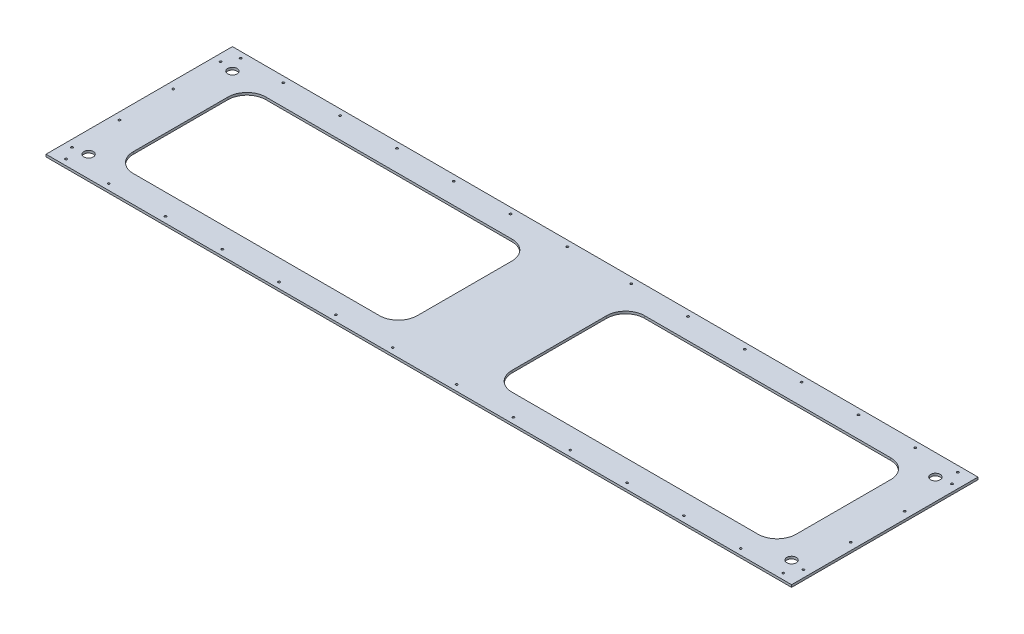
ISO-10303-21;
HEADER;
FILE_DESCRIPTION(('STEP AP214'),'2;1');
FILE_NAME('part.step','',(''),(''),'','','');
FILE_SCHEMA(('AUTOMOTIVE_DESIGN { 1 0 10303 214 1 1 1 1 }'));
ENDSEC;
DATA;
#1=APPLICATION_CONTEXT('core data for automotive mechanical design processes');
#2=APPLICATION_PROTOCOL_DEFINITION('international standard','automotive_design',2000,#1);
#3=PRODUCT_CONTEXT('',#1,'mechanical');
#4=PRODUCT('Part','Part','',(#3));
#5=PRODUCT_RELATED_PRODUCT_CATEGORY('part','',(#4));
#6=PRODUCT_DEFINITION_FORMATION('','',#4);
#7=PRODUCT_DEFINITION_CONTEXT('part definition',#1,'design');
#8=PRODUCT_DEFINITION('design','',#6,#7);
#9=PRODUCT_DEFINITION_SHAPE('','',#8);
#10=(LENGTH_UNIT() NAMED_UNIT(*) SI_UNIT(.MILLI.,.METRE.));
#11=(NAMED_UNIT(*) PLANE_ANGLE_UNIT() SI_UNIT($,.RADIAN.));
#12=(NAMED_UNIT(*) SI_UNIT($,.STERADIAN.) SOLID_ANGLE_UNIT());
#13=UNCERTAINTY_MEASURE_WITH_UNIT(LENGTH_MEASURE(1.E-05),#10,'distance_accuracy_value','');
#14=(GEOMETRIC_REPRESENTATION_CONTEXT(3) GLOBAL_UNCERTAINTY_ASSIGNED_CONTEXT((#13)) GLOBAL_UNIT_ASSIGNED_CONTEXT((#10,
#11,#12)) REPRESENTATION_CONTEXT('',''));
#15=CARTESIAN_POINT('',(0.,0.,0.));
#16=DIRECTION('',(0.,0.,1.));
#17=DIRECTION('',(1.,0.,0.));
#18=AXIS2_PLACEMENT_3D('',#15,#16,#17);
#19=CARTESIAN_POINT('',(0.,6.35,0.));
#20=DIRECTION('',(1.,0.,0.));
#21=DIRECTION('',(0.,0.,-1.));
#22=AXIS2_PLACEMENT_3D('',#19,#20,#21);
#23=PLANE('',#22);
#24=DIRECTION('',(0.,0.,1.));
#25=VECTOR('',#24,1.);
#26=CARTESIAN_POINT('',(0.,0.,0.));
#27=LINE('',#26,#25);
#28=CARTESIAN_POINT('',(0.,0.,-500.126));
#29=VERTEX_POINT('',#28);
#30=CARTESIAN_POINT('',(0.,0.,0.));
#31=VERTEX_POINT('',#30);
#32=EDGE_CURVE('E519',#29,#31,#27,.T.);
#33=ORIENTED_EDGE('',*,*,#32,.T.);
#34=DIRECTION('',(0.,-1.,0.));
#35=VECTOR('',#34,1.);
#36=CARTESIAN_POINT('',(0.,6.35,0.));
#37=LINE('',#36,#35);
#38=CARTESIAN_POINT('',(0.,6.35,0.));
#39=VERTEX_POINT('',#38);
#40=EDGE_CURVE('E11',#39,#31,#37,.T.);
#41=ORIENTED_EDGE('',*,*,#40,.F.);
#42=DIRECTION('',(0.,0.,1.));
#43=VECTOR('',#42,1.);
#44=CARTESIAN_POINT('',(0.,6.35,0.));
#45=LINE('',#44,#43);
#46=CARTESIAN_POINT('',(0.,6.35,-500.126));
#47=VERTEX_POINT('',#46);
#48=EDGE_CURVE('E522',#47,#39,#45,.T.);
#49=ORIENTED_EDGE('',*,*,#48,.F.);
#50=DIRECTION('',(0.,-1.,0.));
#51=VECTOR('',#50,1.);
#52=CARTESIAN_POINT('',(0.,6.35,-500.126));
#53=LINE('',#52,#51);
#54=EDGE_CURVE('E532',#47,#29,#53,.T.);
#55=ORIENTED_EDGE('',*,*,#54,.T.);
#56=EDGE_LOOP('',(#33,#41,#49,#55));
#57=FACE_BOUND('',#56,.T.);
#58=ADVANCED_FACE('F33',(#57),#23,.F.);
#59=CARTESIAN_POINT('',(0.,6.35,0.));
#60=DIRECTION('',(0.,0.,-1.));
#61=DIRECTION('',(-1.,0.,0.));
#62=AXIS2_PLACEMENT_3D('',#59,#60,#61);
#63=PLANE('',#62);
#64=DIRECTION('',(1.,0.,0.));
#65=VECTOR('',#64,1.);
#66=CARTESIAN_POINT('',(0.,0.,0.));
#67=LINE('',#66,#65);
#68=CARTESIAN_POINT('',(2000.25,0.,0.));
#69=VERTEX_POINT('',#68);
#70=EDGE_CURVE('E535',#31,#69,#67,.T.);
#71=ORIENTED_EDGE('',*,*,#70,.T.);
#72=DIRECTION('',(0.,-1.,0.));
#73=VECTOR('',#72,1.);
#74=CARTESIAN_POINT('',(2000.25,6.35,0.));
#75=LINE('',#74,#73);
#76=CARTESIAN_POINT('',(2000.25,6.35,0.));
#77=VERTEX_POINT('',#76);
#78=EDGE_CURVE('E40',#77,#69,#75,.T.);
#79=ORIENTED_EDGE('',*,*,#78,.F.);
#80=DIRECTION('',(1.,0.,0.));
#81=VECTOR('',#80,1.);
#82=CARTESIAN_POINT('',(0.,6.35,0.));
#83=LINE('',#82,#81);
#84=EDGE_CURVE('E525',#39,#77,#83,.T.);
#85=ORIENTED_EDGE('',*,*,#84,.F.);
#86=ORIENTED_EDGE('',*,*,#40,.T.);
#87=EDGE_LOOP('',(#71,#79,#85,#86));
#88=FACE_BOUND('',#87,.T.);
#89=ADVANCED_FACE('F564',(#88),#63,.F.);
#90=CARTESIAN_POINT('',(2000.25,6.35,0.));
#91=DIRECTION('',(-1.,0.,0.));
#92=DIRECTION('',(0.,0.,1.));
#93=AXIS2_PLACEMENT_3D('',#90,#91,#92);
#94=PLANE('',#93);
#95=DIRECTION('',(0.,0.,-1.));
#96=VECTOR('',#95,1.);
#97=CARTESIAN_POINT('',(2000.25,0.,0.));
#98=LINE('',#97,#96);
#99=CARTESIAN_POINT('',(2000.25,0.,-500.126));
#100=VERTEX_POINT('',#99);
#101=EDGE_CURVE('E537',#69,#100,#98,.T.);
#102=ORIENTED_EDGE('',*,*,#101,.T.);
#103=DIRECTION('',(0.,-1.,0.));
#104=VECTOR('',#103,1.);
#105=CARTESIAN_POINT('',(2000.25,6.35,-500.126));
#106=LINE('',#105,#104);
#107=CARTESIAN_POINT('',(2000.25,6.35,-500.126));
#108=VERTEX_POINT('',#107);
#109=EDGE_CURVE('E542',#108,#100,#106,.T.);
#110=ORIENTED_EDGE('',*,*,#109,.F.);
#111=DIRECTION('',(0.,0.,-1.));
#112=VECTOR('',#111,1.);
#113=CARTESIAN_POINT('',(2000.25,6.35,0.));
#114=LINE('',#113,#112);
#115=EDGE_CURVE('E528',#77,#108,#114,.T.);
#116=ORIENTED_EDGE('',*,*,#115,.F.);
#117=ORIENTED_EDGE('',*,*,#78,.T.);
#118=EDGE_LOOP('',(#102,#110,#116,#117));
#119=FACE_BOUND('',#118,.T.);
#120=ADVANCED_FACE('F549',(#119),#94,.F.);
#121=CARTESIAN_POINT('',(0.,6.35,-500.126));
#122=DIRECTION('',(0.,0.,1.));
#123=DIRECTION('',(1.,0.,0.));
#124=AXIS2_PLACEMENT_3D('',#121,#122,#123);
#125=PLANE('',#124);
#126=DIRECTION('',(-1.,0.,0.));
#127=VECTOR('',#126,1.);
#128=CARTESIAN_POINT('',(0.,0.,-500.126));
#129=LINE('',#128,#127);
#130=EDGE_CURVE('E526',#100,#29,#129,.T.);
#131=ORIENTED_EDGE('',*,*,#130,.T.);
#132=ORIENTED_EDGE('',*,*,#54,.F.);
#133=DIRECTION('',(-1.,0.,0.));
#134=VECTOR('',#133,1.);
#135=CARTESIAN_POINT('',(0.,6.35,-500.126));
#136=LINE('',#135,#134);
#137=EDGE_CURVE('E530',#108,#47,#136,.T.);
#138=ORIENTED_EDGE('',*,*,#137,.F.);
#139=ORIENTED_EDGE('',*,*,#109,.T.);
#140=EDGE_LOOP('',(#131,#132,#138,#139));
#141=FACE_BOUND('',#140,.T.);
#142=ADVANCED_FACE('F557',(#141),#125,.F.);
#143=CARTESIAN_POINT('',(0.,6.35,-500.126));
#144=DIRECTION('',(0.,-1.,0.));
#145=DIRECTION('',(0.,0.,-1.));
#146=AXIS2_PLACEMENT_3D('',#143,#144,#145);
#147=PLANE('',#146);
#148=CARTESIAN_POINT('',(1943.1,6.35,-442.976));
#149=DIRECTION('',(0.,1.,0.));
#150=DIRECTION('',(0.,0.,-1.));
#151=AXIS2_PLACEMENT_3D('',#148,#149,#150);
#152=CIRCLE('',#151,12.6999999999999);
#153=CARTESIAN_POINT('',(1943.1,6.35,-455.676));
#154=VERTEX_POINT('',#153);
#155=EDGE_CURVE('E806',#154,#154,#152,.T.);
#156=ORIENTED_EDGE('',*,*,#155,.F.);
#157=EDGE_LOOP('',(#156));
#158=FACE_BOUND('',#157,.T.);
#159=CARTESIAN_POINT('',(1943.1,6.35,-57.15));
#160=DIRECTION('',(0.,1.,0.));
#161=DIRECTION('',(0.,0.,-1.));
#162=AXIS2_PLACEMENT_3D('',#159,#160,#161);
#163=CIRCLE('',#162,12.6999999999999);
#164=CARTESIAN_POINT('',(1943.1,6.35,-69.8499999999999));
#165=VERTEX_POINT('',#164);
#166=EDGE_CURVE('E808',#165,#165,#163,.T.);
#167=ORIENTED_EDGE('',*,*,#166,.F.);
#168=EDGE_LOOP('',(#167));
#169=FACE_BOUND('',#168,.T.);
#170=CARTESIAN_POINT('',(57.15,6.35,-57.15));
#171=DIRECTION('',(0.,1.,0.));
#172=DIRECTION('',(0.,0.,1.));
#173=AXIS2_PLACEMENT_3D('',#170,#171,#172);
#174=CIRCLE('',#173,12.7);
#175=CARTESIAN_POINT('',(57.15,6.35,-44.45));
#176=VERTEX_POINT('',#175);
#177=EDGE_CURVE('E814',#176,#176,#174,.T.);
#178=ORIENTED_EDGE('',*,*,#177,.F.);
#179=EDGE_LOOP('',(#178));
#180=FACE_BOUND('',#179,.T.);
#181=CARTESIAN_POINT('',(57.15,6.35,-442.976));
#182=DIRECTION('',(0.,1.,0.));
#183=DIRECTION('',(0.,0.,1.));
#184=AXIS2_PLACEMENT_3D('',#181,#182,#183);
#185=CIRCLE('',#184,12.7);
#186=CARTESIAN_POINT('',(57.15,6.35,-430.276));
#187=VERTEX_POINT('',#186);
#188=EDGE_CURVE('E194',#187,#187,#185,.T.);
#189=ORIENTED_EDGE('',*,*,#188,.F.);
#190=EDGE_LOOP('',(#189));
#191=FACE_BOUND('',#190,.T.);
#192=DIRECTION('',(0.,0.,1.));
#193=VECTOR('',#192,1.);
#194=CARTESIAN_POINT('',(111.125,6.35,-377.063));
#195=LINE('',#194,#193);
#196=CARTESIAN_POINT('',(111.125,6.35,-377.063));
#197=VERTEX_POINT('',#196);
#198=CARTESIAN_POINT('',(111.125,6.35,-123.063));
#199=VERTEX_POINT('',#198);
#200=EDGE_CURVE('E211',#197,#199,#195,.T.);
#201=ORIENTED_EDGE('',*,*,#200,.F.);
#202=CARTESIAN_POINT('',(161.925,6.35,-377.063));
#203=DIRECTION('',(0.,1.,0.));
#204=DIRECTION('',(0.,0.,1.));
#205=AXIS2_PLACEMENT_3D('',#202,#203,#204);
#206=CIRCLE('',#205,50.8);
#207=CARTESIAN_POINT('',(161.925,6.35,-427.863));
#208=VERTEX_POINT('',#207);
#209=EDGE_CURVE('E47',#208,#197,#206,.T.);
#210=ORIENTED_EDGE('',*,*,#209,.F.);
#211=DIRECTION('',(-1.,0.,0.));
#212=VECTOR('',#211,1.);
#213=CARTESIAN_POINT('',(822.324999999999,6.35,-427.863));
#214=LINE('',#213,#212);
#215=CARTESIAN_POINT('',(822.324999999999,6.35,-427.863));
#216=VERTEX_POINT('',#215);
#217=EDGE_CURVE('E188',#216,#208,#214,.T.);
#218=ORIENTED_EDGE('',*,*,#217,.F.);
#219=CARTESIAN_POINT('',(822.325,6.35,-377.063));
#220=DIRECTION('',(0.,1.,0.));
#221=DIRECTION('',(0.,0.,-1.));
#222=AXIS2_PLACEMENT_3D('',#219,#220,#221);
#223=CIRCLE('',#222,50.8);
#224=CARTESIAN_POINT('',(873.125,6.35,-377.063));
#225=VERTEX_POINT('',#224);
#226=EDGE_CURVE('E191',#225,#216,#223,.T.);
#227=ORIENTED_EDGE('',*,*,#226,.F.);
#228=DIRECTION('',(0.,0.,-1.));
#229=VECTOR('',#228,1.);
#230=CARTESIAN_POINT('',(873.125,6.35,-377.063));
#231=LINE('',#230,#229);
#232=CARTESIAN_POINT('',(873.125,6.35,-123.063));
#233=VERTEX_POINT('',#232);
#234=EDGE_CURVE('E223',#233,#225,#231,.T.);
#235=ORIENTED_EDGE('',*,*,#234,.F.);
#236=CARTESIAN_POINT('',(822.325,6.35,-123.063));
#237=DIRECTION('',(0.,1.,0.));
#238=DIRECTION('',(0.,0.,-1.));
#239=AXIS2_PLACEMENT_3D('',#236,#237,#238);
#240=CIRCLE('',#239,50.8);
#241=CARTESIAN_POINT('',(822.324999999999,6.35,-72.2630000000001));
#242=VERTEX_POINT('',#241);
#243=EDGE_CURVE('E220',#242,#233,#240,.T.);
#244=ORIENTED_EDGE('',*,*,#243,.F.);
#245=DIRECTION('',(1.,0.,0.));
#246=VECTOR('',#245,1.);
#247=CARTESIAN_POINT('',(822.324999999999,6.35,-72.2630000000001));
#248=LINE('',#247,#246);
#249=CARTESIAN_POINT('',(161.925,6.35,-72.2630000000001));
#250=VERTEX_POINT('',#249);
#251=EDGE_CURVE('E217',#250,#242,#248,.T.);
#252=ORIENTED_EDGE('',*,*,#251,.F.);
#253=CARTESIAN_POINT('',(161.925,6.35,-123.063));
#254=DIRECTION('',(0.,1.,0.));
#255=DIRECTION('',(0.,0.,-1.));
#256=AXIS2_PLACEMENT_3D('',#253,#254,#255);
#257=CIRCLE('',#256,50.8);
#258=EDGE_CURVE('E214',#199,#250,#257,.T.);
#259=ORIENTED_EDGE('',*,*,#258,.F.);
#260=EDGE_LOOP('',(#201,#210,#218,#227,#235,#244,#252,#259));
#261=FACE_BOUND('',#260,.T.);
#262=DIRECTION('',(1.,0.,0.));
#263=VECTOR('',#262,1.);
#264=CARTESIAN_POINT('',(1177.925,6.35,-72.2630000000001));
#265=LINE('',#264,#263);
#266=CARTESIAN_POINT('',(1177.925,6.35,-72.2630000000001));
#267=VERTEX_POINT('',#266);
#268=CARTESIAN_POINT('',(1838.325,6.35,-72.2630000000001));
#269=VERTEX_POINT('',#268);
#270=EDGE_CURVE('E269',#267,#269,#265,.T.);
#271=ORIENTED_EDGE('',*,*,#270,.F.);
#272=CARTESIAN_POINT('',(1177.925,6.35,-123.063));
#273=DIRECTION('',(0.,1.,0.));
#274=DIRECTION('',(0.,0.,1.));
#275=AXIS2_PLACEMENT_3D('',#272,#273,#274);
#276=CIRCLE('',#275,50.8);
#277=CARTESIAN_POINT('',(1127.125,6.35,-123.063));
#278=VERTEX_POINT('',#277);
#279=EDGE_CURVE('E230',#278,#267,#276,.T.);
#280=ORIENTED_EDGE('',*,*,#279,.F.);
#281=DIRECTION('',(0.,0.,1.));
#282=VECTOR('',#281,1.);
#283=CARTESIAN_POINT('',(1127.125,6.35,-377.063));
#284=LINE('',#283,#282);
#285=CARTESIAN_POINT('',(1127.125,6.35,-377.063));
#286=VERTEX_POINT('',#285);
#287=EDGE_CURVE('E246',#286,#278,#284,.T.);
#288=ORIENTED_EDGE('',*,*,#287,.F.);
#289=CARTESIAN_POINT('',(1177.925,6.35,-377.063));
#290=DIRECTION('',(0.,1.,0.));
#291=DIRECTION('',(0.,0.,1.));
#292=AXIS2_PLACEMENT_3D('',#289,#290,#291);
#293=CIRCLE('',#292,50.8);
#294=CARTESIAN_POINT('',(1177.925,6.35,-427.863));
#295=VERTEX_POINT('',#294);
#296=EDGE_CURVE('E284',#295,#286,#293,.T.);
#297=ORIENTED_EDGE('',*,*,#296,.F.);
#298=DIRECTION('',(-1.,0.,0.));
#299=VECTOR('',#298,1.);
#300=CARTESIAN_POINT('',(1177.925,6.35,-427.863));
#301=LINE('',#300,#299);
#302=CARTESIAN_POINT('',(1838.325,6.35,-427.863));
#303=VERTEX_POINT('',#302);
#304=EDGE_CURVE('E281',#303,#295,#301,.T.);
#305=ORIENTED_EDGE('',*,*,#304,.F.);
#306=CARTESIAN_POINT('',(1838.325,6.35,-377.063));
#307=DIRECTION('',(0.,1.,0.));
#308=DIRECTION('',(0.,0.,-1.));
#309=AXIS2_PLACEMENT_3D('',#306,#307,#308);
#310=CIRCLE('',#309,50.8);
#311=CARTESIAN_POINT('',(1889.125,6.35,-377.063));
#312=VERTEX_POINT('',#311);
#313=EDGE_CURVE('E278',#312,#303,#310,.T.);
#314=ORIENTED_EDGE('',*,*,#313,.F.);
#315=DIRECTION('',(0.,0.,-1.));
#316=VECTOR('',#315,1.);
#317=CARTESIAN_POINT('',(1889.125,6.35,-377.063));
#318=LINE('',#317,#316);
#319=CARTESIAN_POINT('',(1889.125,6.35,-123.063));
#320=VERTEX_POINT('',#319);
#321=EDGE_CURVE('E275',#320,#312,#318,.T.);
#322=ORIENTED_EDGE('',*,*,#321,.F.);
#323=CARTESIAN_POINT('',(1838.325,6.35,-123.063));
#324=DIRECTION('',(0.,1.,0.));
#325=DIRECTION('',(0.,0.,1.));
#326=AXIS2_PLACEMENT_3D('',#323,#324,#325);
#327=CIRCLE('',#326,50.8);
#328=EDGE_CURVE('E272',#269,#320,#327,.T.);
#329=ORIENTED_EDGE('',*,*,#328,.F.);
#330=EDGE_LOOP('',(#271,#280,#288,#297,#305,#314,#322,#329));
#331=FACE_BOUND('',#330,.T.);
#332=CARTESIAN_POINT('',(1981.19999998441,6.35,-177.799999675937));
#333=DIRECTION('',(0.,1.,0.));
#334=DIRECTION('',(0.,0.,1.));
#335=AXIS2_PLACEMENT_3D('',#332,#333,#334);
#336=CIRCLE('',#335,2.80669999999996);
#337=CARTESIAN_POINT('',(1981.19999998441,6.35,-174.993299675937));
#338=VERTEX_POINT('',#337);
#339=EDGE_CURVE('E291',#338,#338,#336,.T.);
#340=ORIENTED_EDGE('',*,*,#339,.F.);
#341=EDGE_LOOP('',(#340));
#342=FACE_BOUND('',#341,.T.);
#343=CARTESIAN_POINT('',(1981.19999998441,6.35,-322.326));
#344=DIRECTION('',(0.,1.,0.));
#345=DIRECTION('',(0.,0.,1.));
#346=AXIS2_PLACEMENT_3D('',#343,#344,#345);
#347=CIRCLE('',#346,2.8067000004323);
#348=CARTESIAN_POINT('',(1981.19999998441,6.35,-319.519299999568));
#349=VERTEX_POINT('',#348);
#350=EDGE_CURVE('E309',#349,#349,#347,.T.);
#351=ORIENTED_EDGE('',*,*,#350,.F.);
#352=EDGE_LOOP('',(#351));
#353=FACE_BOUND('',#352,.T.);
#354=CARTESIAN_POINT('',(1981.19999998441,6.35,-449.325999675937));
#355=DIRECTION('',(0.,1.,0.));
#356=DIRECTION('',(0.,0.,1.));
#357=AXIS2_PLACEMENT_3D('',#354,#355,#356);
#358=CIRCLE('',#357,2.8067000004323);
#359=CARTESIAN_POINT('',(1981.19999998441,6.35,-446.519299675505));
#360=VERTEX_POINT('',#359);
#361=EDGE_CURVE('E315',#360,#360,#358,.T.);
#362=ORIENTED_EDGE('',*,*,#361,.F.);
#363=EDGE_LOOP('',(#362));
#364=FACE_BOUND('',#363,.T.);
#365=CARTESIAN_POINT('',(1962.14999998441,6.35,-484.250999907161));
#366=DIRECTION('',(0.,1.,0.));
#367=DIRECTION('',(0.,0.,1.));
#368=AXIS2_PLACEMENT_3D('',#365,#366,#367);
#369=CIRCLE('',#368,2.80670000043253);
#370=CARTESIAN_POINT('',(1962.14999998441,6.35,-481.444299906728));
#371=VERTEX_POINT('',#370);
#372=EDGE_CURVE('E321',#371,#371,#369,.T.);
#373=ORIENTED_EDGE('',*,*,#372,.F.);
#374=EDGE_LOOP('',(#373));
#375=FACE_BOUND('',#374,.T.);
#376=CARTESIAN_POINT('',(1847.84999998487,6.35,-484.250999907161));
#377=DIRECTION('',(0.,1.,0.));
#378=DIRECTION('',(0.,0.,1.));
#379=AXIS2_PLACEMENT_3D('',#376,#377,#378);
#380=CIRCLE('',#379,2.80669999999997);
#381=CARTESIAN_POINT('',(1847.84999998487,6.35,-481.444299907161));
#382=VERTEX_POINT('',#381);
#383=EDGE_CURVE('E327',#382,#382,#380,.T.);
#384=ORIENTED_EDGE('',*,*,#383,.F.);
#385=EDGE_LOOP('',(#384));
#386=FACE_BOUND('',#385,.T.);
#387=CARTESIAN_POINT('',(1695.44999998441,6.35,-484.250999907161));
#388=DIRECTION('',(0.,1.,0.));
#389=DIRECTION('',(0.,0.,1.));
#390=AXIS2_PLACEMENT_3D('',#387,#388,#389);
#391=CIRCLE('',#390,2.80670000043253);
#392=CARTESIAN_POINT('',(1695.44999998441,6.35,-481.444299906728));
#393=VERTEX_POINT('',#392);
#394=EDGE_CURVE('E333',#393,#393,#391,.T.);
#395=ORIENTED_EDGE('',*,*,#394,.F.);
#396=EDGE_LOOP('',(#395));
#397=FACE_BOUND('',#396,.T.);
#398=CARTESIAN_POINT('',(1543.04999998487,6.35,-484.250999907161));
#399=DIRECTION('',(0.,1.,0.));
#400=DIRECTION('',(0.,0.,1.));
#401=AXIS2_PLACEMENT_3D('',#398,#399,#400);
#402=CIRCLE('',#401,2.80669999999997);
#403=CARTESIAN_POINT('',(1543.04999998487,6.35,-481.444299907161));
#404=VERTEX_POINT('',#403);
#405=EDGE_CURVE('E339',#404,#404,#402,.T.);
#406=ORIENTED_EDGE('',*,*,#405,.F.);
#407=EDGE_LOOP('',(#406));
#408=FACE_BOUND('',#407,.T.);
#409=CARTESIAN_POINT('',(1390.64999998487,6.35,-484.250999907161));
#410=DIRECTION('',(0.,1.,0.));
#411=DIRECTION('',(0.,0.,1.));
#412=AXIS2_PLACEMENT_3D('',#409,#410,#411);
#413=CIRCLE('',#412,2.80669999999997);
#414=CARTESIAN_POINT('',(1390.64999998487,6.35,-481.444299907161));
#415=VERTEX_POINT('',#414);
#416=EDGE_CURVE('E345',#415,#415,#413,.T.);
#417=ORIENTED_EDGE('',*,*,#416,.F.);
#418=EDGE_LOOP('',(#417));
#419=FACE_BOUND('',#418,.T.);
#420=CARTESIAN_POINT('',(1238.24999998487,6.35,-484.250999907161));
#421=DIRECTION('',(0.,1.,0.));
#422=DIRECTION('',(0.,0.,1.));
#423=AXIS2_PLACEMENT_3D('',#420,#421,#422);
#424=CIRCLE('',#423,2.80669999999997);
#425=CARTESIAN_POINT('',(1238.24999998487,6.35,-481.444299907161));
#426=VERTEX_POINT('',#425);
#427=EDGE_CURVE('E351',#426,#426,#424,.T.);
#428=ORIENTED_EDGE('',*,*,#427,.F.);
#429=EDGE_LOOP('',(#428));
#430=FACE_BOUND('',#429,.T.);
#431=CARTESIAN_POINT('',(1085.84999998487,6.35,-484.250999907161));
#432=DIRECTION('',(0.,1.,0.));
#433=DIRECTION('',(0.,0.,1.));
#434=AXIS2_PLACEMENT_3D('',#431,#432,#433);
#435=CIRCLE('',#434,2.80669999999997);
#436=CARTESIAN_POINT('',(1085.84999998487,6.35,-481.444299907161));
#437=VERTEX_POINT('',#436);
#438=EDGE_CURVE('E357',#437,#437,#435,.T.);
#439=ORIENTED_EDGE('',*,*,#438,.F.);
#440=EDGE_LOOP('',(#439));
#441=FACE_BOUND('',#440,.T.);
#442=CARTESIAN_POINT('',(914.399999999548,6.35,-484.250999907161));
#443=DIRECTION('',(0.,1.,0.));
#444=DIRECTION('',(0.,0.,1.));
#445=AXIS2_PLACEMENT_3D('',#442,#443,#444);
#446=CIRCLE('',#445,2.80670000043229);
#447=CARTESIAN_POINT('',(914.399999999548,6.35,-481.444299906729));
#448=VERTEX_POINT('',#447);
#449=EDGE_CURVE('E363',#448,#448,#446,.T.);
#450=ORIENTED_EDGE('',*,*,#449,.F.);
#451=EDGE_LOOP('',(#450));
#452=FACE_BOUND('',#451,.T.);
#453=CARTESIAN_POINT('',(761.999999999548,6.35,-484.250999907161));
#454=DIRECTION('',(0.,1.,0.));
#455=DIRECTION('',(0.,0.,1.));
#456=AXIS2_PLACEMENT_3D('',#453,#454,#455);
#457=CIRCLE('',#456,2.80670000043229);
#458=CARTESIAN_POINT('',(761.999999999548,6.35,-481.444299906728));
#459=VERTEX_POINT('',#458);
#460=EDGE_CURVE('E369',#459,#459,#457,.T.);
#461=ORIENTED_EDGE('',*,*,#460,.F.);
#462=EDGE_LOOP('',(#461));
#463=FACE_BOUND('',#462,.T.);
#464=CARTESIAN_POINT('',(609.599999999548,6.35,-484.250999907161));
#465=DIRECTION('',(0.,1.,0.));
#466=DIRECTION('',(0.,0.,1.));
#467=AXIS2_PLACEMENT_3D('',#464,#465,#466);
#468=CIRCLE('',#467,2.80670000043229);
#469=CARTESIAN_POINT('',(609.599999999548,6.35,-481.444299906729));
#470=VERTEX_POINT('',#469);
#471=EDGE_CURVE('E375',#470,#470,#468,.T.);
#472=ORIENTED_EDGE('',*,*,#471,.F.);
#473=EDGE_LOOP('',(#472));
#474=FACE_BOUND('',#473,.T.);
#475=CARTESIAN_POINT('',(457.199999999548,6.35,-484.250999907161));
#476=DIRECTION('',(0.,1.,0.));
#477=DIRECTION('',(0.,0.,1.));
#478=AXIS2_PLACEMENT_3D('',#475,#476,#477);
#479=CIRCLE('',#478,2.80670000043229);
#480=CARTESIAN_POINT('',(457.199999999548,6.35,-481.444299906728));
#481=VERTEX_POINT('',#480);
#482=EDGE_CURVE('E381',#481,#481,#479,.T.);
#483=ORIENTED_EDGE('',*,*,#482,.F.);
#484=EDGE_LOOP('',(#483));
#485=FACE_BOUND('',#484,.T.);
#486=CARTESIAN_POINT('',(304.8,6.35,-484.250999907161));
#487=DIRECTION('',(0.,1.,0.));
#488=DIRECTION('',(0.,0.,1.));
#489=AXIS2_PLACEMENT_3D('',#486,#487,#488);
#490=CIRCLE('',#489,2.8067);
#491=CARTESIAN_POINT('',(304.8,6.35,-481.444299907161));
#492=VERTEX_POINT('',#491);
#493=EDGE_CURVE('E387',#492,#492,#490,.T.);
#494=ORIENTED_EDGE('',*,*,#493,.F.);
#495=EDGE_LOOP('',(#494));
#496=FACE_BOUND('',#495,.T.);
#497=CARTESIAN_POINT('',(152.399999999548,6.35,-484.250999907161));
#498=DIRECTION('',(0.,1.,0.));
#499=DIRECTION('',(0.,0.,1.));
#500=AXIS2_PLACEMENT_3D('',#497,#498,#499);
#501=CIRCLE('',#500,2.80670000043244);
#502=CARTESIAN_POINT('',(152.399999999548,6.35,-481.444299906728));
#503=VERTEX_POINT('',#502);
#504=EDGE_CURVE('E393',#503,#503,#501,.T.);
#505=ORIENTED_EDGE('',*,*,#504,.F.);
#506=EDGE_LOOP('',(#505));
#507=FACE_BOUND('',#506,.T.);
#508=CARTESIAN_POINT('',(38.1,6.35,-484.250999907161));
#509=DIRECTION('',(0.,1.,0.));
#510=DIRECTION('',(0.,0.,1.));
#511=AXIS2_PLACEMENT_3D('',#508,#509,#510);
#512=CIRCLE('',#511,2.80669999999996);
#513=CARTESIAN_POINT('',(38.1,6.35,-481.444299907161));
#514=VERTEX_POINT('',#513);
#515=EDGE_CURVE('E399',#514,#514,#512,.T.);
#516=ORIENTED_EDGE('',*,*,#515,.F.);
#517=EDGE_LOOP('',(#516));
#518=FACE_BOUND('',#517,.T.);
#519=CARTESIAN_POINT('',(19.05,6.35,-449.326));
#520=DIRECTION('',(0.,1.,0.));
#521=DIRECTION('',(0.,0.,1.));
#522=AXIS2_PLACEMENT_3D('',#519,#520,#521);
#523=CIRCLE('',#522,2.80669999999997);
#524=CARTESIAN_POINT('',(19.05,6.35,-446.5193));
#525=VERTEX_POINT('',#524);
#526=EDGE_CURVE('E405',#525,#525,#523,.T.);
#527=ORIENTED_EDGE('',*,*,#526,.F.);
#528=EDGE_LOOP('',(#527));
#529=FACE_BOUND('',#528,.T.);
#530=CARTESIAN_POINT('',(19.05,6.35,-322.326));
#531=DIRECTION('',(0.,1.,0.));
#532=DIRECTION('',(0.,0.,1.));
#533=AXIS2_PLACEMENT_3D('',#530,#531,#532);
#534=CIRCLE('',#533,2.80669999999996);
#535=CARTESIAN_POINT('',(19.05,6.35,-319.5193));
#536=VERTEX_POINT('',#535);
#537=EDGE_CURVE('E411',#536,#536,#534,.T.);
#538=ORIENTED_EDGE('',*,*,#537,.F.);
#539=EDGE_LOOP('',(#538));
#540=FACE_BOUND('',#539,.T.);
#541=CARTESIAN_POINT('',(19.05,6.35,-177.799999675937));
#542=DIRECTION('',(0.,1.,0.));
#543=DIRECTION('',(0.,0.,1.));
#544=AXIS2_PLACEMENT_3D('',#541,#542,#543);
#545=CIRCLE('',#544,2.80669999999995);
#546=CARTESIAN_POINT('',(19.05,6.35,-174.993299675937));
#547=VERTEX_POINT('',#546);
#548=EDGE_CURVE('E417',#547,#547,#545,.T.);
#549=ORIENTED_EDGE('',*,*,#548,.F.);
#550=EDGE_LOOP('',(#549));
#551=FACE_BOUND('',#550,.T.);
#552=CARTESIAN_POINT('',(19.0500000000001,6.35,-50.8));
#553=DIRECTION('',(0.,1.,0.));
#554=DIRECTION('',(0.,0.,1.));
#555=AXIS2_PLACEMENT_3D('',#552,#553,#554);
#556=CIRCLE('',#555,2.80669999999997);
#557=CARTESIAN_POINT('',(19.0500000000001,6.35,-47.9933));
#558=VERTEX_POINT('',#557);
#559=EDGE_CURVE('E423',#558,#558,#556,.T.);
#560=ORIENTED_EDGE('',*,*,#559,.F.);
#561=EDGE_LOOP('',(#560));
#562=FACE_BOUND('',#561,.T.);
#563=CARTESIAN_POINT('',(38.1,6.35,-15.8749997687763));
#564=DIRECTION('',(0.,1.,0.));
#565=DIRECTION('',(0.,0.,1.));
#566=AXIS2_PLACEMENT_3D('',#563,#564,#565);
#567=CIRCLE('',#566,2.80669999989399);
#568=CARTESIAN_POINT('',(38.1,6.35,-13.0682997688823));
#569=VERTEX_POINT('',#568);
#570=EDGE_CURVE('E429',#569,#569,#567,.T.);
#571=ORIENTED_EDGE('',*,*,#570,.F.);
#572=EDGE_LOOP('',(#571));
#573=FACE_BOUND('',#572,.T.);
#574=CARTESIAN_POINT('',(152.399999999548,6.35,-15.8749997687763));
#575=DIRECTION('',(0.,1.,0.));
#576=DIRECTION('',(0.,0.,1.));
#577=AXIS2_PLACEMENT_3D('',#574,#575,#576);
#578=CIRCLE('',#577,2.80669999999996);
#579=CARTESIAN_POINT('',(152.399999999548,6.35,-13.0682997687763));
#580=VERTEX_POINT('',#579);
#581=EDGE_CURVE('E435',#580,#580,#578,.T.);
#582=ORIENTED_EDGE('',*,*,#581,.F.);
#583=EDGE_LOOP('',(#582));
#584=FACE_BOUND('',#583,.T.);
#585=CARTESIAN_POINT('',(304.8,6.35,-15.8749997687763));
#586=DIRECTION('',(0.,1.,0.));
#587=DIRECTION('',(0.,0.,1.));
#588=AXIS2_PLACEMENT_3D('',#585,#586,#587);
#589=CIRCLE('',#588,2.80669999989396);
#590=CARTESIAN_POINT('',(304.8,6.35,-13.0682997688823));
#591=VERTEX_POINT('',#590);
#592=EDGE_CURVE('E441',#591,#591,#589,.T.);
#593=ORIENTED_EDGE('',*,*,#592,.F.);
#594=EDGE_LOOP('',(#593));
#595=FACE_BOUND('',#594,.T.);
#596=CARTESIAN_POINT('',(457.199999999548,6.35,-15.8749997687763));
#597=DIRECTION('',(0.,1.,0.));
#598=DIRECTION('',(0.,0.,1.));
#599=AXIS2_PLACEMENT_3D('',#596,#597,#598);
#600=CIRCLE('',#599,2.80669999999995);
#601=CARTESIAN_POINT('',(457.199999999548,6.35,-13.0682997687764));
#602=VERTEX_POINT('',#601);
#603=EDGE_CURVE('E447',#602,#602,#600,.T.);
#604=ORIENTED_EDGE('',*,*,#603,.F.);
#605=EDGE_LOOP('',(#604));
#606=FACE_BOUND('',#605,.T.);
#607=CARTESIAN_POINT('',(609.599999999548,6.35,-15.8749997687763));
#608=DIRECTION('',(0.,1.,0.));
#609=DIRECTION('',(0.,0.,1.));
#610=AXIS2_PLACEMENT_3D('',#607,#608,#609);
#611=CIRCLE('',#610,2.80669999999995);
#612=CARTESIAN_POINT('',(609.599999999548,6.35,-13.0682997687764));
#613=VERTEX_POINT('',#612);
#614=EDGE_CURVE('E453',#613,#613,#611,.T.);
#615=ORIENTED_EDGE('',*,*,#614,.F.);
#616=EDGE_LOOP('',(#615));
#617=FACE_BOUND('',#616,.T.);
#618=CARTESIAN_POINT('',(761.999999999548,6.35,-15.8749997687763));
#619=DIRECTION('',(0.,1.,0.));
#620=DIRECTION('',(0.,0.,1.));
#621=AXIS2_PLACEMENT_3D('',#618,#619,#620);
#622=CIRCLE('',#621,2.80669999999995);
#623=CARTESIAN_POINT('',(761.999999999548,6.35,-13.0682997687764));
#624=VERTEX_POINT('',#623);
#625=EDGE_CURVE('E459',#624,#624,#622,.T.);
#626=ORIENTED_EDGE('',*,*,#625,.F.);
#627=EDGE_LOOP('',(#626));
#628=FACE_BOUND('',#627,.T.);
#629=CARTESIAN_POINT('',(914.399999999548,6.35,-15.8749997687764));
#630=DIRECTION('',(0.,1.,0.));
#631=DIRECTION('',(0.,0.,1.));
#632=AXIS2_PLACEMENT_3D('',#629,#630,#631);
#633=CIRCLE('',#632,2.80669999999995);
#634=CARTESIAN_POINT('',(914.399999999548,6.35,-13.0682997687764));
#635=VERTEX_POINT('',#634);
#636=EDGE_CURVE('E465',#635,#635,#633,.T.);
#637=ORIENTED_EDGE('',*,*,#636,.F.);
#638=EDGE_LOOP('',(#637));
#639=FACE_BOUND('',#638,.T.);
#640=CARTESIAN_POINT('',(1085.84999998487,6.35,-15.8749997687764));
#641=DIRECTION('',(0.,1.,0.));
#642=DIRECTION('',(0.,0.,1.));
#643=AXIS2_PLACEMENT_3D('',#640,#641,#642);
#644=CIRCLE('',#643,2.80669999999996);
#645=CARTESIAN_POINT('',(1085.84999998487,6.35,-13.0682997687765));
#646=VERTEX_POINT('',#645);
#647=EDGE_CURVE('E471',#646,#646,#644,.T.);
#648=ORIENTED_EDGE('',*,*,#647,.F.);
#649=EDGE_LOOP('',(#648));
#650=FACE_BOUND('',#649,.T.);
#651=CARTESIAN_POINT('',(1238.24999998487,6.35,-15.8749997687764));
#652=DIRECTION('',(0.,1.,0.));
#653=DIRECTION('',(0.,0.,1.));
#654=AXIS2_PLACEMENT_3D('',#651,#652,#653);
#655=CIRCLE('',#654,2.80669999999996);
#656=CARTESIAN_POINT('',(1238.24999998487,6.35,-13.0682997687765));
#657=VERTEX_POINT('',#656);
#658=EDGE_CURVE('E477',#657,#657,#655,.T.);
#659=ORIENTED_EDGE('',*,*,#658,.F.);
#660=EDGE_LOOP('',(#659));
#661=FACE_BOUND('',#660,.T.);
#662=CARTESIAN_POINT('',(1390.64999998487,6.35,-15.8749997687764));
#663=DIRECTION('',(0.,1.,0.));
#664=DIRECTION('',(0.,0.,1.));
#665=AXIS2_PLACEMENT_3D('',#662,#663,#664);
#666=CIRCLE('',#665,2.80669999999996);
#667=CARTESIAN_POINT('',(1390.64999998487,6.35,-13.0682997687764));
#668=VERTEX_POINT('',#667);
#669=EDGE_CURVE('E483',#668,#668,#666,.T.);
#670=ORIENTED_EDGE('',*,*,#669,.F.);
#671=EDGE_LOOP('',(#670));
#672=FACE_BOUND('',#671,.T.);
#673=CARTESIAN_POINT('',(1543.04999998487,6.35,-15.8749997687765));
#674=DIRECTION('',(0.,1.,0.));
#675=DIRECTION('',(0.,0.,1.));
#676=AXIS2_PLACEMENT_3D('',#673,#674,#675);
#677=CIRCLE('',#676,2.80669999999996);
#678=CARTESIAN_POINT('',(1543.04999998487,6.35,-13.0682997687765));
#679=VERTEX_POINT('',#678);
#680=EDGE_CURVE('E489',#679,#679,#677,.T.);
#681=ORIENTED_EDGE('',*,*,#680,.F.);
#682=EDGE_LOOP('',(#681));
#683=FACE_BOUND('',#682,.T.);
#684=CARTESIAN_POINT('',(1695.44999998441,6.35,-15.8749997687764));
#685=DIRECTION('',(0.,1.,0.));
#686=DIRECTION('',(0.,0.,1.));
#687=AXIS2_PLACEMENT_3D('',#684,#685,#686);
#688=CIRCLE('',#687,2.80669999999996);
#689=CARTESIAN_POINT('',(1695.44999998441,6.35,-13.0682997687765));
#690=VERTEX_POINT('',#689);
#691=EDGE_CURVE('E495',#690,#690,#688,.T.);
#692=ORIENTED_EDGE('',*,*,#691,.F.);
#693=EDGE_LOOP('',(#692));
#694=FACE_BOUND('',#693,.T.);
#695=CARTESIAN_POINT('',(1981.19999998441,6.35,-50.8));
#696=DIRECTION('',(0.,1.,0.));
#697=DIRECTION('',(0.,0.,1.));
#698=AXIS2_PLACEMENT_3D('',#695,#696,#697);
#699=CIRCLE('',#698,2.80669999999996);
#700=CARTESIAN_POINT('',(1981.19999998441,6.35,-47.9933));
#701=VERTEX_POINT('',#700);
#702=EDGE_CURVE('E501',#701,#701,#699,.T.);
#703=ORIENTED_EDGE('',*,*,#702,.F.);
#704=EDGE_LOOP('',(#703));
#705=FACE_BOUND('',#704,.T.);
#706=CARTESIAN_POINT('',(1847.84999998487,6.35,-15.8749997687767));
#707=DIRECTION('',(0.,1.,0.));
#708=DIRECTION('',(0.,0.,1.));
#709=AXIS2_PLACEMENT_3D('',#706,#707,#708);
#710=CIRCLE('',#709,2.80669999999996);
#711=CARTESIAN_POINT('',(1847.84999998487,6.35,-13.0682997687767));
#712=VERTEX_POINT('',#711);
#713=EDGE_CURVE('E507',#712,#712,#710,.T.);
#714=ORIENTED_EDGE('',*,*,#713,.F.);
#715=EDGE_LOOP('',(#714));
#716=FACE_BOUND('',#715,.T.);
#717=CARTESIAN_POINT('',(1962.14999998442,6.35,-15.8749997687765));
#718=DIRECTION('',(0.,1.,0.));
#719=DIRECTION('',(0.,0.,1.));
#720=AXIS2_PLACEMENT_3D('',#717,#718,#719);
#721=CIRCLE('',#720,2.80669999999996);
#722=CARTESIAN_POINT('',(1962.14999998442,6.35,-13.0682997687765));
#723=VERTEX_POINT('',#722);
#724=EDGE_CURVE('E513',#723,#723,#721,.T.);
#725=ORIENTED_EDGE('',*,*,#724,.F.);
#726=EDGE_LOOP('',(#725));
#727=FACE_BOUND('',#726,.T.);
#728=ORIENTED_EDGE('',*,*,#48,.T.);
#729=ORIENTED_EDGE('',*,*,#84,.T.);
#730=ORIENTED_EDGE('',*,*,#115,.T.);
#731=ORIENTED_EDGE('',*,*,#137,.T.);
#732=EDGE_LOOP('',(#728,#729,#730,#731));
#733=FACE_BOUND('',#732,.T.);
#734=ADVANCED_FACE('F563',(#158,#169,#180,#191,#261,#331,#342,#353,#364,#375,#386,#397,#408,
#419,#430,#441,#452,#463,#474,#485,#496,#507,#518,#529,#540,#551,#562,#573,#584,#595,#606,#617,
#628,#639,#650,#661,#672,#683,#694,#705,#716,#727,#733),#147,.F.);
#735=CARTESIAN_POINT('',(0.,0.,-500.126));
#736=DIRECTION('',(0.,-1.,0.));
#737=DIRECTION('',(0.,0.,-1.));
#738=AXIS2_PLACEMENT_3D('',#735,#736,#737);
#739=PLANE('',#738);
#740=CARTESIAN_POINT('',(1943.1,0.,-442.976));
#741=DIRECTION('',(0.,1.,0.));
#742=DIRECTION('',(0.,0.,-1.));
#743=AXIS2_PLACEMENT_3D('',#740,#741,#742);
#744=CIRCLE('',#743,12.6999999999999);
#745=CARTESIAN_POINT('',(1943.1,0.,-455.676));
#746=VERTEX_POINT('',#745);
#747=EDGE_CURVE('E803',#746,#746,#744,.T.);
#748=ORIENTED_EDGE('',*,*,#747,.T.);
#749=EDGE_LOOP('',(#748));
#750=FACE_BOUND('',#749,.T.);
#751=CARTESIAN_POINT('',(1943.1,0.,-57.15));
#752=DIRECTION('',(0.,1.,0.));
#753=DIRECTION('',(0.,0.,-1.));
#754=AXIS2_PLACEMENT_3D('',#751,#752,#753);
#755=CIRCLE('',#754,12.6999999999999);
#756=CARTESIAN_POINT('',(1943.1,0.,-69.8499999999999));
#757=VERTEX_POINT('',#756);
#758=EDGE_CURVE('E811',#757,#757,#755,.T.);
#759=ORIENTED_EDGE('',*,*,#758,.T.);
#760=EDGE_LOOP('',(#759));
#761=FACE_BOUND('',#760,.T.);
#762=CARTESIAN_POINT('',(57.15,0.,-57.15));
#763=DIRECTION('',(0.,1.,0.));
#764=DIRECTION('',(0.,0.,1.));
#765=AXIS2_PLACEMENT_3D('',#762,#763,#764);
#766=CIRCLE('',#765,12.7);
#767=CARTESIAN_POINT('',(57.15,0.,-44.45));
#768=VERTEX_POINT('',#767);
#769=EDGE_CURVE('E817',#768,#768,#766,.T.);
#770=ORIENTED_EDGE('',*,*,#769,.T.);
#771=EDGE_LOOP('',(#770));
#772=FACE_BOUND('',#771,.T.);
#773=CARTESIAN_POINT('',(57.15,0.,-442.976));
#774=DIRECTION('',(0.,1.,0.));
#775=DIRECTION('',(0.,0.,1.));
#776=AXIS2_PLACEMENT_3D('',#773,#774,#775);
#777=CIRCLE('',#776,12.7);
#778=CARTESIAN_POINT('',(57.15,0.,-430.276));
#779=VERTEX_POINT('',#778);
#780=EDGE_CURVE('E212',#779,#779,#777,.T.);
#781=ORIENTED_EDGE('',*,*,#780,.T.);
#782=EDGE_LOOP('',(#781));
#783=FACE_BOUND('',#782,.T.);
#784=CARTESIAN_POINT('',(161.925,0.,-377.063));
#785=DIRECTION('',(0.,1.,0.));
#786=DIRECTION('',(0.,0.,1.));
#787=AXIS2_PLACEMENT_3D('',#784,#785,#786);
#788=CIRCLE('',#787,50.8);
#789=CARTESIAN_POINT('',(161.925,0.,-427.863));
#790=VERTEX_POINT('',#789);
#791=CARTESIAN_POINT('',(111.125,0.,-377.063));
#792=VERTEX_POINT('',#791);
#793=EDGE_CURVE('E171',#790,#792,#788,.T.);
#794=ORIENTED_EDGE('',*,*,#793,.T.);
#795=DIRECTION('',(0.,0.,1.));
#796=VECTOR('',#795,1.);
#797=CARTESIAN_POINT('',(111.125,0.,-377.063));
#798=LINE('',#797,#796);
#799=CARTESIAN_POINT('',(111.125,0.,-123.063));
#800=VERTEX_POINT('',#799);
#801=EDGE_CURVE('E180',#792,#800,#798,.T.);
#802=ORIENTED_EDGE('',*,*,#801,.T.);
#803=CARTESIAN_POINT('',(161.925,0.,-123.063));
#804=DIRECTION('',(0.,1.,0.));
#805=DIRECTION('',(0.,0.,-1.));
#806=AXIS2_PLACEMENT_3D('',#803,#804,#805);
#807=CIRCLE('',#806,50.8);
#808=CARTESIAN_POINT('',(161.925,0.,-72.2630000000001));
#809=VERTEX_POINT('',#808);
#810=EDGE_CURVE('E55',#800,#809,#807,.T.);
#811=ORIENTED_EDGE('',*,*,#810,.T.);
#812=DIRECTION('',(1.,0.,0.));
#813=VECTOR('',#812,1.);
#814=CARTESIAN_POINT('',(822.324999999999,0.,-72.2630000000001));
#815=LINE('',#814,#813);
#816=CARTESIAN_POINT('',(822.324999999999,0.,-72.2630000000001));
#817=VERTEX_POINT('',#816);
#818=EDGE_CURVE('E198',#809,#817,#815,.T.);
#819=ORIENTED_EDGE('',*,*,#818,.T.);
#820=CARTESIAN_POINT('',(822.325,0.,-123.063));
#821=DIRECTION('',(0.,1.,0.));
#822=DIRECTION('',(0.,0.,-1.));
#823=AXIS2_PLACEMENT_3D('',#820,#821,#822);
#824=CIRCLE('',#823,50.8);
#825=CARTESIAN_POINT('',(873.125,0.,-123.063));
#826=VERTEX_POINT('',#825);
#827=EDGE_CURVE('E201',#817,#826,#824,.T.);
#828=ORIENTED_EDGE('',*,*,#827,.T.);
#829=DIRECTION('',(0.,0.,-1.));
#830=VECTOR('',#829,1.);
#831=CARTESIAN_POINT('',(873.125,0.,-377.063));
#832=LINE('',#831,#830);
#833=CARTESIAN_POINT('',(873.125,0.,-377.063));
#834=VERTEX_POINT('',#833);
#835=EDGE_CURVE('E204',#826,#834,#832,.T.);
#836=ORIENTED_EDGE('',*,*,#835,.T.);
#837=CARTESIAN_POINT('',(822.325,0.,-377.063));
#838=DIRECTION('',(0.,1.,0.));
#839=DIRECTION('',(0.,0.,-1.));
#840=AXIS2_PLACEMENT_3D('',#837,#838,#839);
#841=CIRCLE('',#840,50.8);
#842=CARTESIAN_POINT('',(822.324999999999,0.,-427.863));
#843=VERTEX_POINT('',#842);
#844=EDGE_CURVE('E207',#834,#843,#841,.T.);
#845=ORIENTED_EDGE('',*,*,#844,.T.);
#846=DIRECTION('',(-1.,0.,0.));
#847=VECTOR('',#846,1.);
#848=CARTESIAN_POINT('',(822.324999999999,0.,-427.863));
#849=LINE('',#848,#847);
#850=EDGE_CURVE('E177',#843,#790,#849,.T.);
#851=ORIENTED_EDGE('',*,*,#850,.T.);
#852=EDGE_LOOP('',(#794,#802,#811,#819,#828,#836,#845,#851));
#853=FACE_BOUND('',#852,.T.);
#854=CARTESIAN_POINT('',(1177.925,0.,-123.063));
#855=DIRECTION('',(0.,1.,0.));
#856=DIRECTION('',(0.,0.,1.));
#857=AXIS2_PLACEMENT_3D('',#854,#855,#856);
#858=CIRCLE('',#857,50.8);
#859=CARTESIAN_POINT('',(1127.125,0.,-123.063));
#860=VERTEX_POINT('',#859);
#861=CARTESIAN_POINT('',(1177.925,0.,-72.2630000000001));
#862=VERTEX_POINT('',#861);
#863=EDGE_CURVE('E242',#860,#862,#858,.T.);
#864=ORIENTED_EDGE('',*,*,#863,.T.);
#865=DIRECTION('',(1.,0.,0.));
#866=VECTOR('',#865,1.);
#867=CARTESIAN_POINT('',(1177.925,0.,-72.2630000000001));
#868=LINE('',#867,#866);
#869=CARTESIAN_POINT('',(1838.325,0.,-72.2630000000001));
#870=VERTEX_POINT('',#869);
#871=EDGE_CURVE('E245',#862,#870,#868,.T.);
#872=ORIENTED_EDGE('',*,*,#871,.T.);
#873=CARTESIAN_POINT('',(1838.325,0.,-123.063));
#874=DIRECTION('',(0.,1.,0.));
#875=DIRECTION('',(0.,0.,1.));
#876=AXIS2_PLACEMENT_3D('',#873,#874,#875);
#877=CIRCLE('',#876,50.8);
#878=CARTESIAN_POINT('',(1889.125,0.,-123.063));
#879=VERTEX_POINT('',#878);
#880=EDGE_CURVE('E249',#870,#879,#877,.T.);
#881=ORIENTED_EDGE('',*,*,#880,.T.);
#882=DIRECTION('',(0.,0.,-1.));
#883=VECTOR('',#882,1.);
#884=CARTESIAN_POINT('',(1889.125,0.,-377.063));
#885=LINE('',#884,#883);
#886=CARTESIAN_POINT('',(1889.125,0.,-377.063));
#887=VERTEX_POINT('',#886);
#888=EDGE_CURVE('E252',#879,#887,#885,.T.);
#889=ORIENTED_EDGE('',*,*,#888,.T.);
#890=CARTESIAN_POINT('',(1838.325,0.,-377.063));
#891=DIRECTION('',(0.,1.,0.));
#892=DIRECTION('',(0.,0.,-1.));
#893=AXIS2_PLACEMENT_3D('',#890,#891,#892);
#894=CIRCLE('',#893,50.8);
#895=CARTESIAN_POINT('',(1838.325,0.,-427.863));
#896=VERTEX_POINT('',#895);
#897=EDGE_CURVE('E255',#887,#896,#894,.T.);
#898=ORIENTED_EDGE('',*,*,#897,.T.);
#899=DIRECTION('',(-1.,0.,0.));
#900=VECTOR('',#899,1.);
#901=CARTESIAN_POINT('',(1177.925,0.,-427.863));
#902=LINE('',#901,#900);
#903=CARTESIAN_POINT('',(1177.925,0.,-427.863));
#904=VERTEX_POINT('',#903);
#905=EDGE_CURVE('E258',#896,#904,#902,.T.);
#906=ORIENTED_EDGE('',*,*,#905,.T.);
#907=CARTESIAN_POINT('',(1177.925,0.,-377.063));
#908=DIRECTION('',(0.,1.,0.));
#909=DIRECTION('',(0.,0.,1.));
#910=AXIS2_PLACEMENT_3D('',#907,#908,#909);
#911=CIRCLE('',#910,50.8);
#912=CARTESIAN_POINT('',(1127.125,0.,-377.063));
#913=VERTEX_POINT('',#912);
#914=EDGE_CURVE('E261',#904,#913,#911,.T.);
#915=ORIENTED_EDGE('',*,*,#914,.T.);
#916=DIRECTION('',(0.,0.,1.));
#917=VECTOR('',#916,1.);
#918=CARTESIAN_POINT('',(1127.125,0.,-377.063));
#919=LINE('',#918,#917);
#920=EDGE_CURVE('E264',#913,#860,#919,.T.);
#921=ORIENTED_EDGE('',*,*,#920,.T.);
#922=EDGE_LOOP('',(#864,#872,#881,#889,#898,#906,#915,#921));
#923=FACE_BOUND('',#922,.T.);
#924=CARTESIAN_POINT('',(1981.19999998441,0.,-177.799999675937));
#925=DIRECTION('',(0.,1.,0.));
#926=DIRECTION('',(0.,0.,1.));
#927=AXIS2_PLACEMENT_3D('',#924,#925,#926);
#928=CIRCLE('',#927,2.80669999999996);
#929=CARTESIAN_POINT('',(1981.19999998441,0.,-174.993299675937));
#930=VERTEX_POINT('',#929);
#931=EDGE_CURVE('E306',#930,#930,#928,.T.);
#932=ORIENTED_EDGE('',*,*,#931,.T.);
#933=EDGE_LOOP('',(#932));
#934=FACE_BOUND('',#933,.T.);
#935=CARTESIAN_POINT('',(1981.19999998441,0.,-322.326));
#936=DIRECTION('',(0.,1.,0.));
#937=DIRECTION('',(0.,0.,1.));
#938=AXIS2_PLACEMENT_3D('',#935,#936,#937);
#939=CIRCLE('',#938,2.8067000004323);
#940=CARTESIAN_POINT('',(1981.19999998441,0.,-319.519299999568));
#941=VERTEX_POINT('',#940);
#942=EDGE_CURVE('E312',#941,#941,#939,.T.);
#943=ORIENTED_EDGE('',*,*,#942,.T.);
#944=EDGE_LOOP('',(#943));
#945=FACE_BOUND('',#944,.T.);
#946=CARTESIAN_POINT('',(1981.19999998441,0.,-449.325999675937));
#947=DIRECTION('',(0.,1.,0.));
#948=DIRECTION('',(0.,0.,1.));
#949=AXIS2_PLACEMENT_3D('',#946,#947,#948);
#950=CIRCLE('',#949,2.8067000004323);
#951=CARTESIAN_POINT('',(1981.19999998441,0.,-446.519299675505));
#952=VERTEX_POINT('',#951);
#953=EDGE_CURVE('E318',#952,#952,#950,.T.);
#954=ORIENTED_EDGE('',*,*,#953,.T.);
#955=EDGE_LOOP('',(#954));
#956=FACE_BOUND('',#955,.T.);
#957=CARTESIAN_POINT('',(1962.14999998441,0.,-484.250999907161));
#958=DIRECTION('',(0.,1.,0.));
#959=DIRECTION('',(0.,0.,1.));
#960=AXIS2_PLACEMENT_3D('',#957,#958,#959);
#961=CIRCLE('',#960,2.80670000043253);
#962=CARTESIAN_POINT('',(1962.14999998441,0.,-481.444299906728));
#963=VERTEX_POINT('',#962);
#964=EDGE_CURVE('E324',#963,#963,#961,.T.);
#965=ORIENTED_EDGE('',*,*,#964,.T.);
#966=EDGE_LOOP('',(#965));
#967=FACE_BOUND('',#966,.T.);
#968=CARTESIAN_POINT('',(1847.84999998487,0.,-484.250999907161));
#969=DIRECTION('',(0.,1.,0.));
#970=DIRECTION('',(0.,0.,1.));
#971=AXIS2_PLACEMENT_3D('',#968,#969,#970);
#972=CIRCLE('',#971,2.80669999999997);
#973=CARTESIAN_POINT('',(1847.84999998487,0.,-481.444299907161));
#974=VERTEX_POINT('',#973);
#975=EDGE_CURVE('E330',#974,#974,#972,.T.);
#976=ORIENTED_EDGE('',*,*,#975,.T.);
#977=EDGE_LOOP('',(#976));
#978=FACE_BOUND('',#977,.T.);
#979=CARTESIAN_POINT('',(1695.44999998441,0.,-484.250999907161));
#980=DIRECTION('',(0.,1.,0.));
#981=DIRECTION('',(0.,0.,1.));
#982=AXIS2_PLACEMENT_3D('',#979,#980,#981);
#983=CIRCLE('',#982,2.80670000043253);
#984=CARTESIAN_POINT('',(1695.44999998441,0.,-481.444299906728));
#985=VERTEX_POINT('',#984);
#986=EDGE_CURVE('E336',#985,#985,#983,.T.);
#987=ORIENTED_EDGE('',*,*,#986,.T.);
#988=EDGE_LOOP('',(#987));
#989=FACE_BOUND('',#988,.T.);
#990=CARTESIAN_POINT('',(1543.04999998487,0.,-484.250999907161));
#991=DIRECTION('',(0.,1.,0.));
#992=DIRECTION('',(0.,0.,1.));
#993=AXIS2_PLACEMENT_3D('',#990,#991,#992);
#994=CIRCLE('',#993,2.80669999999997);
#995=CARTESIAN_POINT('',(1543.04999998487,0.,-481.444299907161));
#996=VERTEX_POINT('',#995);
#997=EDGE_CURVE('E342',#996,#996,#994,.T.);
#998=ORIENTED_EDGE('',*,*,#997,.T.);
#999=EDGE_LOOP('',(#998));
#1000=FACE_BOUND('',#999,.T.);
#1001=CARTESIAN_POINT('',(1390.64999998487,0.,-484.250999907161));
#1002=DIRECTION('',(0.,1.,0.));
#1003=DIRECTION('',(0.,0.,1.));
#1004=AXIS2_PLACEMENT_3D('',#1001,#1002,#1003);
#1005=CIRCLE('',#1004,2.80669999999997);
#1006=CARTESIAN_POINT('',(1390.64999998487,0.,-481.444299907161));
#1007=VERTEX_POINT('',#1006);
#1008=EDGE_CURVE('E348',#1007,#1007,#1005,.T.);
#1009=ORIENTED_EDGE('',*,*,#1008,.T.);
#1010=EDGE_LOOP('',(#1009));
#1011=FACE_BOUND('',#1010,.T.);
#1012=CARTESIAN_POINT('',(1238.24999998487,0.,-484.250999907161));
#1013=DIRECTION('',(0.,1.,0.));
#1014=DIRECTION('',(0.,0.,1.));
#1015=AXIS2_PLACEMENT_3D('',#1012,#1013,#1014);
#1016=CIRCLE('',#1015,2.80669999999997);
#1017=CARTESIAN_POINT('',(1238.24999998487,0.,-481.444299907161));
#1018=VERTEX_POINT('',#1017);
#1019=EDGE_CURVE('E354',#1018,#1018,#1016,.T.);
#1020=ORIENTED_EDGE('',*,*,#1019,.T.);
#1021=EDGE_LOOP('',(#1020));
#1022=FACE_BOUND('',#1021,.T.);
#1023=CARTESIAN_POINT('',(1085.84999998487,0.,-484.250999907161));
#1024=DIRECTION('',(0.,1.,0.));
#1025=DIRECTION('',(0.,0.,1.));
#1026=AXIS2_PLACEMENT_3D('',#1023,#1024,#1025);
#1027=CIRCLE('',#1026,2.80669999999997);
#1028=CARTESIAN_POINT('',(1085.84999998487,0.,-481.444299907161));
#1029=VERTEX_POINT('',#1028);
#1030=EDGE_CURVE('E360',#1029,#1029,#1027,.T.);
#1031=ORIENTED_EDGE('',*,*,#1030,.T.);
#1032=EDGE_LOOP('',(#1031));
#1033=FACE_BOUND('',#1032,.T.);
#1034=CARTESIAN_POINT('',(914.399999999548,0.,-484.250999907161));
#1035=DIRECTION('',(0.,1.,0.));
#1036=DIRECTION('',(0.,0.,1.));
#1037=AXIS2_PLACEMENT_3D('',#1034,#1035,#1036);
#1038=CIRCLE('',#1037,2.80670000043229);
#1039=CARTESIAN_POINT('',(914.399999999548,0.,-481.444299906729));
#1040=VERTEX_POINT('',#1039);
#1041=EDGE_CURVE('E366',#1040,#1040,#1038,.T.);
#1042=ORIENTED_EDGE('',*,*,#1041,.T.);
#1043=EDGE_LOOP('',(#1042));
#1044=FACE_BOUND('',#1043,.T.);
#1045=CARTESIAN_POINT('',(761.999999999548,0.,-484.250999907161));
#1046=DIRECTION('',(0.,1.,0.));
#1047=DIRECTION('',(0.,0.,1.));
#1048=AXIS2_PLACEMENT_3D('',#1045,#1046,#1047);
#1049=CIRCLE('',#1048,2.80670000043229);
#1050=CARTESIAN_POINT('',(761.999999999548,0.,-481.444299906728));
#1051=VERTEX_POINT('',#1050);
#1052=EDGE_CURVE('E372',#1051,#1051,#1049,.T.);
#1053=ORIENTED_EDGE('',*,*,#1052,.T.);
#1054=EDGE_LOOP('',(#1053));
#1055=FACE_BOUND('',#1054,.T.);
#1056=CARTESIAN_POINT('',(609.599999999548,0.,-484.250999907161));
#1057=DIRECTION('',(0.,1.,0.));
#1058=DIRECTION('',(0.,0.,1.));
#1059=AXIS2_PLACEMENT_3D('',#1056,#1057,#1058);
#1060=CIRCLE('',#1059,2.80670000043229);
#1061=CARTESIAN_POINT('',(609.599999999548,0.,-481.444299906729));
#1062=VERTEX_POINT('',#1061);
#1063=EDGE_CURVE('E378',#1062,#1062,#1060,.T.);
#1064=ORIENTED_EDGE('',*,*,#1063,.T.);
#1065=EDGE_LOOP('',(#1064));
#1066=FACE_BOUND('',#1065,.T.);
#1067=CARTESIAN_POINT('',(457.199999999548,0.,-484.250999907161));
#1068=DIRECTION('',(0.,1.,0.));
#1069=DIRECTION('',(0.,0.,1.));
#1070=AXIS2_PLACEMENT_3D('',#1067,#1068,#1069);
#1071=CIRCLE('',#1070,2.80670000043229);
#1072=CARTESIAN_POINT('',(457.199999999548,0.,-481.444299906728));
#1073=VERTEX_POINT('',#1072);
#1074=EDGE_CURVE('E384',#1073,#1073,#1071,.T.);
#1075=ORIENTED_EDGE('',*,*,#1074,.T.);
#1076=EDGE_LOOP('',(#1075));
#1077=FACE_BOUND('',#1076,.T.);
#1078=CARTESIAN_POINT('',(304.8,0.,-484.250999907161));
#1079=DIRECTION('',(0.,1.,0.));
#1080=DIRECTION('',(0.,0.,1.));
#1081=AXIS2_PLACEMENT_3D('',#1078,#1079,#1080);
#1082=CIRCLE('',#1081,2.8067);
#1083=CARTESIAN_POINT('',(304.8,0.,-481.444299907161));
#1084=VERTEX_POINT('',#1083);
#1085=EDGE_CURVE('E390',#1084,#1084,#1082,.T.);
#1086=ORIENTED_EDGE('',*,*,#1085,.T.);
#1087=EDGE_LOOP('',(#1086));
#1088=FACE_BOUND('',#1087,.T.);
#1089=CARTESIAN_POINT('',(152.399999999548,0.,-484.250999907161));
#1090=DIRECTION('',(0.,1.,0.));
#1091=DIRECTION('',(0.,0.,1.));
#1092=AXIS2_PLACEMENT_3D('',#1089,#1090,#1091);
#1093=CIRCLE('',#1092,2.80670000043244);
#1094=CARTESIAN_POINT('',(152.399999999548,0.,-481.444299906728));
#1095=VERTEX_POINT('',#1094);
#1096=EDGE_CURVE('E396',#1095,#1095,#1093,.T.);
#1097=ORIENTED_EDGE('',*,*,#1096,.T.);
#1098=EDGE_LOOP('',(#1097));
#1099=FACE_BOUND('',#1098,.T.);
#1100=CARTESIAN_POINT('',(38.1,0.,-484.250999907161));
#1101=DIRECTION('',(0.,1.,0.));
#1102=DIRECTION('',(0.,0.,1.));
#1103=AXIS2_PLACEMENT_3D('',#1100,#1101,#1102);
#1104=CIRCLE('',#1103,2.80669999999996);
#1105=CARTESIAN_POINT('',(38.1,0.,-481.444299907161));
#1106=VERTEX_POINT('',#1105);
#1107=EDGE_CURVE('E402',#1106,#1106,#1104,.T.);
#1108=ORIENTED_EDGE('',*,*,#1107,.T.);
#1109=EDGE_LOOP('',(#1108));
#1110=FACE_BOUND('',#1109,.T.);
#1111=CARTESIAN_POINT('',(19.05,0.,-449.326));
#1112=DIRECTION('',(0.,1.,0.));
#1113=DIRECTION('',(0.,0.,1.));
#1114=AXIS2_PLACEMENT_3D('',#1111,#1112,#1113);
#1115=CIRCLE('',#1114,2.80669999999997);
#1116=CARTESIAN_POINT('',(19.05,0.,-446.5193));
#1117=VERTEX_POINT('',#1116);
#1118=EDGE_CURVE('E408',#1117,#1117,#1115,.T.);
#1119=ORIENTED_EDGE('',*,*,#1118,.T.);
#1120=EDGE_LOOP('',(#1119));
#1121=FACE_BOUND('',#1120,.T.);
#1122=CARTESIAN_POINT('',(19.05,0.,-322.326));
#1123=DIRECTION('',(0.,1.,0.));
#1124=DIRECTION('',(0.,0.,1.));
#1125=AXIS2_PLACEMENT_3D('',#1122,#1123,#1124);
#1126=CIRCLE('',#1125,2.80669999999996);
#1127=CARTESIAN_POINT('',(19.05,0.,-319.5193));
#1128=VERTEX_POINT('',#1127);
#1129=EDGE_CURVE('E414',#1128,#1128,#1126,.T.);
#1130=ORIENTED_EDGE('',*,*,#1129,.T.);
#1131=EDGE_LOOP('',(#1130));
#1132=FACE_BOUND('',#1131,.T.);
#1133=CARTESIAN_POINT('',(19.05,0.,-177.799999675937));
#1134=DIRECTION('',(0.,1.,0.));
#1135=DIRECTION('',(0.,0.,1.));
#1136=AXIS2_PLACEMENT_3D('',#1133,#1134,#1135);
#1137=CIRCLE('',#1136,2.80669999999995);
#1138=CARTESIAN_POINT('',(19.05,0.,-174.993299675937));
#1139=VERTEX_POINT('',#1138);
#1140=EDGE_CURVE('E420',#1139,#1139,#1137,.T.);
#1141=ORIENTED_EDGE('',*,*,#1140,.T.);
#1142=EDGE_LOOP('',(#1141));
#1143=FACE_BOUND('',#1142,.T.);
#1144=CARTESIAN_POINT('',(19.0500000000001,0.,-50.8));
#1145=DIRECTION('',(0.,1.,0.));
#1146=DIRECTION('',(0.,0.,1.));
#1147=AXIS2_PLACEMENT_3D('',#1144,#1145,#1146);
#1148=CIRCLE('',#1147,2.80669999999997);
#1149=CARTESIAN_POINT('',(19.0500000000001,0.,-47.9933));
#1150=VERTEX_POINT('',#1149);
#1151=EDGE_CURVE('E426',#1150,#1150,#1148,.T.);
#1152=ORIENTED_EDGE('',*,*,#1151,.T.);
#1153=EDGE_LOOP('',(#1152));
#1154=FACE_BOUND('',#1153,.T.);
#1155=CARTESIAN_POINT('',(38.1,0.,-15.8749997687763));
#1156=DIRECTION('',(0.,1.,0.));
#1157=DIRECTION('',(0.,0.,1.));
#1158=AXIS2_PLACEMENT_3D('',#1155,#1156,#1157);
#1159=CIRCLE('',#1158,2.80669999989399);
#1160=CARTESIAN_POINT('',(38.1,0.,-13.0682997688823));
#1161=VERTEX_POINT('',#1160);
#1162=EDGE_CURVE('E432',#1161,#1161,#1159,.T.);
#1163=ORIENTED_EDGE('',*,*,#1162,.T.);
#1164=EDGE_LOOP('',(#1163));
#1165=FACE_BOUND('',#1164,.T.);
#1166=CARTESIAN_POINT('',(152.399999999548,0.,-15.8749997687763));
#1167=DIRECTION('',(0.,1.,0.));
#1168=DIRECTION('',(0.,0.,1.));
#1169=AXIS2_PLACEMENT_3D('',#1166,#1167,#1168);
#1170=CIRCLE('',#1169,2.80669999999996);
#1171=CARTESIAN_POINT('',(152.399999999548,0.,-13.0682997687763));
#1172=VERTEX_POINT('',#1171);
#1173=EDGE_CURVE('E438',#1172,#1172,#1170,.T.);
#1174=ORIENTED_EDGE('',*,*,#1173,.T.);
#1175=EDGE_LOOP('',(#1174));
#1176=FACE_BOUND('',#1175,.T.);
#1177=CARTESIAN_POINT('',(304.8,0.,-15.8749997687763));
#1178=DIRECTION('',(0.,1.,0.));
#1179=DIRECTION('',(0.,0.,1.));
#1180=AXIS2_PLACEMENT_3D('',#1177,#1178,#1179);
#1181=CIRCLE('',#1180,2.80669999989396);
#1182=CARTESIAN_POINT('',(304.8,0.,-13.0682997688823));
#1183=VERTEX_POINT('',#1182);
#1184=EDGE_CURVE('E444',#1183,#1183,#1181,.T.);
#1185=ORIENTED_EDGE('',*,*,#1184,.T.);
#1186=EDGE_LOOP('',(#1185));
#1187=FACE_BOUND('',#1186,.T.);
#1188=CARTESIAN_POINT('',(457.199999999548,0.,-15.8749997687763));
#1189=DIRECTION('',(0.,1.,0.));
#1190=DIRECTION('',(0.,0.,1.));
#1191=AXIS2_PLACEMENT_3D('',#1188,#1189,#1190);
#1192=CIRCLE('',#1191,2.80669999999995);
#1193=CARTESIAN_POINT('',(457.199999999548,0.,-13.0682997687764));
#1194=VERTEX_POINT('',#1193);
#1195=EDGE_CURVE('E450',#1194,#1194,#1192,.T.);
#1196=ORIENTED_EDGE('',*,*,#1195,.T.);
#1197=EDGE_LOOP('',(#1196));
#1198=FACE_BOUND('',#1197,.T.);
#1199=CARTESIAN_POINT('',(609.599999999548,0.,-15.8749997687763));
#1200=DIRECTION('',(0.,1.,0.));
#1201=DIRECTION('',(0.,0.,1.));
#1202=AXIS2_PLACEMENT_3D('',#1199,#1200,#1201);
#1203=CIRCLE('',#1202,2.80669999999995);
#1204=CARTESIAN_POINT('',(609.599999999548,0.,-13.0682997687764));
#1205=VERTEX_POINT('',#1204);
#1206=EDGE_CURVE('E456',#1205,#1205,#1203,.T.);
#1207=ORIENTED_EDGE('',*,*,#1206,.T.);
#1208=EDGE_LOOP('',(#1207));
#1209=FACE_BOUND('',#1208,.T.);
#1210=CARTESIAN_POINT('',(761.999999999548,0.,-15.8749997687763));
#1211=DIRECTION('',(0.,1.,0.));
#1212=DIRECTION('',(0.,0.,1.));
#1213=AXIS2_PLACEMENT_3D('',#1210,#1211,#1212);
#1214=CIRCLE('',#1213,2.80669999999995);
#1215=CARTESIAN_POINT('',(761.999999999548,0.,-13.0682997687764));
#1216=VERTEX_POINT('',#1215);
#1217=EDGE_CURVE('E462',#1216,#1216,#1214,.T.);
#1218=ORIENTED_EDGE('',*,*,#1217,.T.);
#1219=EDGE_LOOP('',(#1218));
#1220=FACE_BOUND('',#1219,.T.);
#1221=CARTESIAN_POINT('',(914.399999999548,0.,-15.8749997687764));
#1222=DIRECTION('',(0.,1.,0.));
#1223=DIRECTION('',(0.,0.,1.));
#1224=AXIS2_PLACEMENT_3D('',#1221,#1222,#1223);
#1225=CIRCLE('',#1224,2.80669999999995);
#1226=CARTESIAN_POINT('',(914.399999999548,0.,-13.0682997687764));
#1227=VERTEX_POINT('',#1226);
#1228=EDGE_CURVE('E468',#1227,#1227,#1225,.T.);
#1229=ORIENTED_EDGE('',*,*,#1228,.T.);
#1230=EDGE_LOOP('',(#1229));
#1231=FACE_BOUND('',#1230,.T.);
#1232=CARTESIAN_POINT('',(1085.84999998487,0.,-15.8749997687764));
#1233=DIRECTION('',(0.,1.,0.));
#1234=DIRECTION('',(0.,0.,1.));
#1235=AXIS2_PLACEMENT_3D('',#1232,#1233,#1234);
#1236=CIRCLE('',#1235,2.80669999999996);
#1237=CARTESIAN_POINT('',(1085.84999998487,0.,-13.0682997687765));
#1238=VERTEX_POINT('',#1237);
#1239=EDGE_CURVE('E474',#1238,#1238,#1236,.T.);
#1240=ORIENTED_EDGE('',*,*,#1239,.T.);
#1241=EDGE_LOOP('',(#1240));
#1242=FACE_BOUND('',#1241,.T.);
#1243=CARTESIAN_POINT('',(1238.24999998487,0.,-15.8749997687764));
#1244=DIRECTION('',(0.,1.,0.));
#1245=DIRECTION('',(0.,0.,1.));
#1246=AXIS2_PLACEMENT_3D('',#1243,#1244,#1245);
#1247=CIRCLE('',#1246,2.80669999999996);
#1248=CARTESIAN_POINT('',(1238.24999998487,0.,-13.0682997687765));
#1249=VERTEX_POINT('',#1248);
#1250=EDGE_CURVE('E480',#1249,#1249,#1247,.T.);
#1251=ORIENTED_EDGE('',*,*,#1250,.T.);
#1252=EDGE_LOOP('',(#1251));
#1253=FACE_BOUND('',#1252,.T.);
#1254=CARTESIAN_POINT('',(1390.64999998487,0.,-15.8749997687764));
#1255=DIRECTION('',(0.,1.,0.));
#1256=DIRECTION('',(0.,0.,1.));
#1257=AXIS2_PLACEMENT_3D('',#1254,#1255,#1256);
#1258=CIRCLE('',#1257,2.80669999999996);
#1259=CARTESIAN_POINT('',(1390.64999998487,0.,-13.0682997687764));
#1260=VERTEX_POINT('',#1259);
#1261=EDGE_CURVE('E486',#1260,#1260,#1258,.T.);
#1262=ORIENTED_EDGE('',*,*,#1261,.T.);
#1263=EDGE_LOOP('',(#1262));
#1264=FACE_BOUND('',#1263,.T.);
#1265=CARTESIAN_POINT('',(1543.04999998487,0.,-15.8749997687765));
#1266=DIRECTION('',(0.,1.,0.));
#1267=DIRECTION('',(0.,0.,1.));
#1268=AXIS2_PLACEMENT_3D('',#1265,#1266,#1267);
#1269=CIRCLE('',#1268,2.80669999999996);
#1270=CARTESIAN_POINT('',(1543.04999998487,0.,-13.0682997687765));
#1271=VERTEX_POINT('',#1270);
#1272=EDGE_CURVE('E492',#1271,#1271,#1269,.T.);
#1273=ORIENTED_EDGE('',*,*,#1272,.T.);
#1274=EDGE_LOOP('',(#1273));
#1275=FACE_BOUND('',#1274,.T.);
#1276=CARTESIAN_POINT('',(1695.44999998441,0.,-15.8749997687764));
#1277=DIRECTION('',(0.,1.,0.));
#1278=DIRECTION('',(0.,0.,1.));
#1279=AXIS2_PLACEMENT_3D('',#1276,#1277,#1278);
#1280=CIRCLE('',#1279,2.80669999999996);
#1281=CARTESIAN_POINT('',(1695.44999998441,0.,-13.0682997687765));
#1282=VERTEX_POINT('',#1281);
#1283=EDGE_CURVE('E498',#1282,#1282,#1280,.T.);
#1284=ORIENTED_EDGE('',*,*,#1283,.T.);
#1285=EDGE_LOOP('',(#1284));
#1286=FACE_BOUND('',#1285,.T.);
#1287=CARTESIAN_POINT('',(1981.19999998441,0.,-50.8));
#1288=DIRECTION('',(0.,1.,0.));
#1289=DIRECTION('',(0.,0.,1.));
#1290=AXIS2_PLACEMENT_3D('',#1287,#1288,#1289);
#1291=CIRCLE('',#1290,2.80669999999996);
#1292=CARTESIAN_POINT('',(1981.19999998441,0.,-47.9933));
#1293=VERTEX_POINT('',#1292);
#1294=EDGE_CURVE('E504',#1293,#1293,#1291,.T.);
#1295=ORIENTED_EDGE('',*,*,#1294,.T.);
#1296=EDGE_LOOP('',(#1295));
#1297=FACE_BOUND('',#1296,.T.);
#1298=CARTESIAN_POINT('',(1847.84999998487,0.,-15.8749997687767));
#1299=DIRECTION('',(0.,1.,0.));
#1300=DIRECTION('',(0.,0.,1.));
#1301=AXIS2_PLACEMENT_3D('',#1298,#1299,#1300);
#1302=CIRCLE('',#1301,2.80669999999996);
#1303=CARTESIAN_POINT('',(1847.84999998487,0.,-13.0682997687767));
#1304=VERTEX_POINT('',#1303);
#1305=EDGE_CURVE('E510',#1304,#1304,#1302,.T.);
#1306=ORIENTED_EDGE('',*,*,#1305,.T.);
#1307=EDGE_LOOP('',(#1306));
#1308=FACE_BOUND('',#1307,.T.);
#1309=CARTESIAN_POINT('',(1962.14999998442,0.,-15.8749997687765));
#1310=DIRECTION('',(0.,1.,0.));
#1311=DIRECTION('',(0.,0.,1.));
#1312=AXIS2_PLACEMENT_3D('',#1309,#1310,#1311);
#1313=CIRCLE('',#1312,2.80669999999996);
#1314=CARTESIAN_POINT('',(1962.14999998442,0.,-13.0682997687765));
#1315=VERTEX_POINT('',#1314);
#1316=EDGE_CURVE('E516',#1315,#1315,#1313,.T.);
#1317=ORIENTED_EDGE('',*,*,#1316,.T.);
#1318=EDGE_LOOP('',(#1317));
#1319=FACE_BOUND('',#1318,.T.);
#1320=ORIENTED_EDGE('',*,*,#32,.F.);
#1321=ORIENTED_EDGE('',*,*,#130,.F.);
#1322=ORIENTED_EDGE('',*,*,#101,.F.);
#1323=ORIENTED_EDGE('',*,*,#70,.F.);
#1324=EDGE_LOOP('',(#1320,#1321,#1322,#1323));
#1325=FACE_BOUND('',#1324,.T.);
#1326=ADVANCED_FACE('F184',(#750,#761,#772,#783,#853,#923,#934,#945,#956,#967,#978,#989,#1000,
#1011,#1022,#1033,#1044,#1055,#1066,#1077,#1088,#1099,#1110,#1121,#1132,#1143,#1154,#1165,#1176,
#1187,#1198,#1209,#1220,#1231,#1242,#1253,#1264,#1275,#1286,#1297,#1308,#1319,#1325),#739,.T.);
#1327=CARTESIAN_POINT('',(1962.14999998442,0.,-15.8749997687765));
#1328=DIRECTION('',(0.,1.,0.));
#1329=DIRECTION('',(0.,0.,1.));
#1330=AXIS2_PLACEMENT_3D('',#1327,#1328,#1329);
#1331=CYLINDRICAL_SURFACE('',#1330,2.80669999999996);
#1332=ORIENTED_EDGE('',*,*,#1316,.F.);
#1333=EDGE_LOOP('',(#1332));
#1334=FACE_BOUND('',#1333,.T.);
#1335=ORIENTED_EDGE('',*,*,#724,.T.);
#1336=EDGE_LOOP('',(#1335));
#1337=FACE_BOUND('',#1336,.T.);
#1338=ADVANCED_FACE('F576',(#1334,#1337),#1331,.F.);
#1339=CARTESIAN_POINT('',(1847.84999998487,0.,-15.8749997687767));
#1340=DIRECTION('',(0.,1.,0.));
#1341=DIRECTION('',(0.,0.,1.));
#1342=AXIS2_PLACEMENT_3D('',#1339,#1340,#1341);
#1343=CYLINDRICAL_SURFACE('',#1342,2.80669999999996);
#1344=ORIENTED_EDGE('',*,*,#1305,.F.);
#1345=EDGE_LOOP('',(#1344));
#1346=FACE_BOUND('',#1345,.T.);
#1347=ORIENTED_EDGE('',*,*,#713,.T.);
#1348=EDGE_LOOP('',(#1347));
#1349=FACE_BOUND('',#1348,.T.);
#1350=ADVANCED_FACE('F583',(#1346,#1349),#1343,.F.);
#1351=CARTESIAN_POINT('',(1981.19999998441,0.,-50.8));
#1352=DIRECTION('',(0.,1.,0.));
#1353=DIRECTION('',(0.,0.,1.));
#1354=AXIS2_PLACEMENT_3D('',#1351,#1352,#1353);
#1355=CYLINDRICAL_SURFACE('',#1354,2.80669999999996);
#1356=ORIENTED_EDGE('',*,*,#1294,.F.);
#1357=EDGE_LOOP('',(#1356));
#1358=FACE_BOUND('',#1357,.T.);
#1359=ORIENTED_EDGE('',*,*,#702,.T.);
#1360=EDGE_LOOP('',(#1359));
#1361=FACE_BOUND('',#1360,.T.);
#1362=ADVANCED_FACE('F587',(#1358,#1361),#1355,.F.);
#1363=CARTESIAN_POINT('',(1695.44999998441,0.,-15.8749997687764));
#1364=DIRECTION('',(0.,1.,0.));
#1365=DIRECTION('',(0.,0.,1.));
#1366=AXIS2_PLACEMENT_3D('',#1363,#1364,#1365);
#1367=CYLINDRICAL_SURFACE('',#1366,2.80669999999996);
#1368=ORIENTED_EDGE('',*,*,#1283,.F.);
#1369=EDGE_LOOP('',(#1368));
#1370=FACE_BOUND('',#1369,.T.);
#1371=ORIENTED_EDGE('',*,*,#691,.T.);
#1372=EDGE_LOOP('',(#1371));
#1373=FACE_BOUND('',#1372,.T.);
#1374=ADVANCED_FACE('F591',(#1370,#1373),#1367,.F.);
#1375=CARTESIAN_POINT('',(1543.04999998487,0.,-15.8749997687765));
#1376=DIRECTION('',(0.,1.,0.));
#1377=DIRECTION('',(0.,0.,1.));
#1378=AXIS2_PLACEMENT_3D('',#1375,#1376,#1377);
#1379=CYLINDRICAL_SURFACE('',#1378,2.80669999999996);
#1380=ORIENTED_EDGE('',*,*,#1272,.F.);
#1381=EDGE_LOOP('',(#1380));
#1382=FACE_BOUND('',#1381,.T.);
#1383=ORIENTED_EDGE('',*,*,#680,.T.);
#1384=EDGE_LOOP('',(#1383));
#1385=FACE_BOUND('',#1384,.T.);
#1386=ADVANCED_FACE('F595',(#1382,#1385),#1379,.F.);
#1387=CARTESIAN_POINT('',(1390.64999998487,0.,-15.8749997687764));
#1388=DIRECTION('',(0.,1.,0.));
#1389=DIRECTION('',(0.,0.,1.));
#1390=AXIS2_PLACEMENT_3D('',#1387,#1388,#1389);
#1391=CYLINDRICAL_SURFACE('',#1390,2.80669999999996);
#1392=ORIENTED_EDGE('',*,*,#1261,.F.);
#1393=EDGE_LOOP('',(#1392));
#1394=FACE_BOUND('',#1393,.T.);
#1395=ORIENTED_EDGE('',*,*,#669,.T.);
#1396=EDGE_LOOP('',(#1395));
#1397=FACE_BOUND('',#1396,.T.);
#1398=ADVANCED_FACE('F599',(#1394,#1397),#1391,.F.);
#1399=CARTESIAN_POINT('',(1238.24999998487,0.,-15.8749997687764));
#1400=DIRECTION('',(0.,1.,0.));
#1401=DIRECTION('',(0.,0.,1.));
#1402=AXIS2_PLACEMENT_3D('',#1399,#1400,#1401);
#1403=CYLINDRICAL_SURFACE('',#1402,2.80669999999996);
#1404=ORIENTED_EDGE('',*,*,#1250,.F.);
#1405=EDGE_LOOP('',(#1404));
#1406=FACE_BOUND('',#1405,.T.);
#1407=ORIENTED_EDGE('',*,*,#658,.T.);
#1408=EDGE_LOOP('',(#1407));
#1409=FACE_BOUND('',#1408,.T.);
#1410=ADVANCED_FACE('F603',(#1406,#1409),#1403,.F.);
#1411=CARTESIAN_POINT('',(1085.84999998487,0.,-15.8749997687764));
#1412=DIRECTION('',(0.,1.,0.));
#1413=DIRECTION('',(0.,0.,1.));
#1414=AXIS2_PLACEMENT_3D('',#1411,#1412,#1413);
#1415=CYLINDRICAL_SURFACE('',#1414,2.80669999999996);
#1416=ORIENTED_EDGE('',*,*,#1239,.F.);
#1417=EDGE_LOOP('',(#1416));
#1418=FACE_BOUND('',#1417,.T.);
#1419=ORIENTED_EDGE('',*,*,#647,.T.);
#1420=EDGE_LOOP('',(#1419));
#1421=FACE_BOUND('',#1420,.T.);
#1422=ADVANCED_FACE('F607',(#1418,#1421),#1415,.F.);
#1423=CARTESIAN_POINT('',(914.399999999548,0.,-15.8749997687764));
#1424=DIRECTION('',(0.,1.,0.));
#1425=DIRECTION('',(0.,0.,1.));
#1426=AXIS2_PLACEMENT_3D('',#1423,#1424,#1425);
#1427=CYLINDRICAL_SURFACE('',#1426,2.80669999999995);
#1428=ORIENTED_EDGE('',*,*,#1228,.F.);
#1429=EDGE_LOOP('',(#1428));
#1430=FACE_BOUND('',#1429,.T.);
#1431=ORIENTED_EDGE('',*,*,#636,.T.);
#1432=EDGE_LOOP('',(#1431));
#1433=FACE_BOUND('',#1432,.T.);
#1434=ADVANCED_FACE('F611',(#1430,#1433),#1427,.F.);
#1435=CARTESIAN_POINT('',(761.999999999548,0.,-15.8749997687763));
#1436=DIRECTION('',(0.,1.,0.));
#1437=DIRECTION('',(0.,0.,1.));
#1438=AXIS2_PLACEMENT_3D('',#1435,#1436,#1437);
#1439=CYLINDRICAL_SURFACE('',#1438,2.80669999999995);
#1440=ORIENTED_EDGE('',*,*,#1217,.F.);
#1441=EDGE_LOOP('',(#1440));
#1442=FACE_BOUND('',#1441,.T.);
#1443=ORIENTED_EDGE('',*,*,#625,.T.);
#1444=EDGE_LOOP('',(#1443));
#1445=FACE_BOUND('',#1444,.T.);
#1446=ADVANCED_FACE('F615',(#1442,#1445),#1439,.F.);
#1447=CARTESIAN_POINT('',(609.599999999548,0.,-15.8749997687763));
#1448=DIRECTION('',(0.,1.,0.));
#1449=DIRECTION('',(0.,0.,1.));
#1450=AXIS2_PLACEMENT_3D('',#1447,#1448,#1449);
#1451=CYLINDRICAL_SURFACE('',#1450,2.80669999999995);
#1452=ORIENTED_EDGE('',*,*,#1206,.F.);
#1453=EDGE_LOOP('',(#1452));
#1454=FACE_BOUND('',#1453,.T.);
#1455=ORIENTED_EDGE('',*,*,#614,.T.);
#1456=EDGE_LOOP('',(#1455));
#1457=FACE_BOUND('',#1456,.T.);
#1458=ADVANCED_FACE('F619',(#1454,#1457),#1451,.F.);
#1459=CARTESIAN_POINT('',(457.199999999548,0.,-15.8749997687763));
#1460=DIRECTION('',(0.,1.,0.));
#1461=DIRECTION('',(0.,0.,1.));
#1462=AXIS2_PLACEMENT_3D('',#1459,#1460,#1461);
#1463=CYLINDRICAL_SURFACE('',#1462,2.80669999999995);
#1464=ORIENTED_EDGE('',*,*,#1195,.F.);
#1465=EDGE_LOOP('',(#1464));
#1466=FACE_BOUND('',#1465,.T.);
#1467=ORIENTED_EDGE('',*,*,#603,.T.);
#1468=EDGE_LOOP('',(#1467));
#1469=FACE_BOUND('',#1468,.T.);
#1470=ADVANCED_FACE('F623',(#1466,#1469),#1463,.F.);
#1471=CARTESIAN_POINT('',(304.8,0.,-15.8749997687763));
#1472=DIRECTION('',(0.,1.,0.));
#1473=DIRECTION('',(0.,0.,1.));
#1474=AXIS2_PLACEMENT_3D('',#1471,#1472,#1473);
#1475=CYLINDRICAL_SURFACE('',#1474,2.80669999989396);
#1476=ORIENTED_EDGE('',*,*,#1184,.F.);
#1477=EDGE_LOOP('',(#1476));
#1478=FACE_BOUND('',#1477,.T.);
#1479=ORIENTED_EDGE('',*,*,#592,.T.);
#1480=EDGE_LOOP('',(#1479));
#1481=FACE_BOUND('',#1480,.T.);
#1482=ADVANCED_FACE('F627',(#1478,#1481),#1475,.F.);
#1483=CARTESIAN_POINT('',(152.399999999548,0.,-15.8749997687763));
#1484=DIRECTION('',(0.,1.,0.));
#1485=DIRECTION('',(0.,0.,1.));
#1486=AXIS2_PLACEMENT_3D('',#1483,#1484,#1485);
#1487=CYLINDRICAL_SURFACE('',#1486,2.80669999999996);
#1488=ORIENTED_EDGE('',*,*,#1173,.F.);
#1489=EDGE_LOOP('',(#1488));
#1490=FACE_BOUND('',#1489,.T.);
#1491=ORIENTED_EDGE('',*,*,#581,.T.);
#1492=EDGE_LOOP('',(#1491));
#1493=FACE_BOUND('',#1492,.T.);
#1494=ADVANCED_FACE('F631',(#1490,#1493),#1487,.F.);
#1495=CARTESIAN_POINT('',(38.1,0.,-15.8749997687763));
#1496=DIRECTION('',(0.,1.,0.));
#1497=DIRECTION('',(0.,0.,1.));
#1498=AXIS2_PLACEMENT_3D('',#1495,#1496,#1497);
#1499=CYLINDRICAL_SURFACE('',#1498,2.80669999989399);
#1500=ORIENTED_EDGE('',*,*,#1162,.F.);
#1501=EDGE_LOOP('',(#1500));
#1502=FACE_BOUND('',#1501,.T.);
#1503=ORIENTED_EDGE('',*,*,#570,.T.);
#1504=EDGE_LOOP('',(#1503));
#1505=FACE_BOUND('',#1504,.T.);
#1506=ADVANCED_FACE('F635',(#1502,#1505),#1499,.F.);
#1507=CARTESIAN_POINT('',(19.0500000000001,0.,-50.8));
#1508=DIRECTION('',(0.,1.,0.));
#1509=DIRECTION('',(0.,0.,1.));
#1510=AXIS2_PLACEMENT_3D('',#1507,#1508,#1509);
#1511=CYLINDRICAL_SURFACE('',#1510,2.80669999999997);
#1512=ORIENTED_EDGE('',*,*,#1151,.F.);
#1513=EDGE_LOOP('',(#1512));
#1514=FACE_BOUND('',#1513,.T.);
#1515=ORIENTED_EDGE('',*,*,#559,.T.);
#1516=EDGE_LOOP('',(#1515));
#1517=FACE_BOUND('',#1516,.T.);
#1518=ADVANCED_FACE('F639',(#1514,#1517),#1511,.F.);
#1519=CARTESIAN_POINT('',(19.05,0.,-177.799999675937));
#1520=DIRECTION('',(0.,1.,0.));
#1521=DIRECTION('',(0.,0.,1.));
#1522=AXIS2_PLACEMENT_3D('',#1519,#1520,#1521);
#1523=CYLINDRICAL_SURFACE('',#1522,2.80669999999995);
#1524=ORIENTED_EDGE('',*,*,#1140,.F.);
#1525=EDGE_LOOP('',(#1524));
#1526=FACE_BOUND('',#1525,.T.);
#1527=ORIENTED_EDGE('',*,*,#548,.T.);
#1528=EDGE_LOOP('',(#1527));
#1529=FACE_BOUND('',#1528,.T.);
#1530=ADVANCED_FACE('F643',(#1526,#1529),#1523,.F.);
#1531=CARTESIAN_POINT('',(19.05,0.,-322.326));
#1532=DIRECTION('',(0.,1.,0.));
#1533=DIRECTION('',(0.,0.,1.));
#1534=AXIS2_PLACEMENT_3D('',#1531,#1532,#1533);
#1535=CYLINDRICAL_SURFACE('',#1534,2.80669999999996);
#1536=ORIENTED_EDGE('',*,*,#1129,.F.);
#1537=EDGE_LOOP('',(#1536));
#1538=FACE_BOUND('',#1537,.T.);
#1539=ORIENTED_EDGE('',*,*,#537,.T.);
#1540=EDGE_LOOP('',(#1539));
#1541=FACE_BOUND('',#1540,.T.);
#1542=ADVANCED_FACE('F647',(#1538,#1541),#1535,.F.);
#1543=CARTESIAN_POINT('',(19.05,0.,-449.326));
#1544=DIRECTION('',(0.,1.,0.));
#1545=DIRECTION('',(0.,0.,1.));
#1546=AXIS2_PLACEMENT_3D('',#1543,#1544,#1545);
#1547=CYLINDRICAL_SURFACE('',#1546,2.80669999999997);
#1548=ORIENTED_EDGE('',*,*,#1118,.F.);
#1549=EDGE_LOOP('',(#1548));
#1550=FACE_BOUND('',#1549,.T.);
#1551=ORIENTED_EDGE('',*,*,#526,.T.);
#1552=EDGE_LOOP('',(#1551));
#1553=FACE_BOUND('',#1552,.T.);
#1554=ADVANCED_FACE('F651',(#1550,#1553),#1547,.F.);
#1555=CARTESIAN_POINT('',(38.1,0.,-484.250999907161));
#1556=DIRECTION('',(0.,1.,0.));
#1557=DIRECTION('',(0.,0.,1.));
#1558=AXIS2_PLACEMENT_3D('',#1555,#1556,#1557);
#1559=CYLINDRICAL_SURFACE('',#1558,2.80669999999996);
#1560=ORIENTED_EDGE('',*,*,#1107,.F.);
#1561=EDGE_LOOP('',(#1560));
#1562=FACE_BOUND('',#1561,.T.);
#1563=ORIENTED_EDGE('',*,*,#515,.T.);
#1564=EDGE_LOOP('',(#1563));
#1565=FACE_BOUND('',#1564,.T.);
#1566=ADVANCED_FACE('F655',(#1562,#1565),#1559,.F.);
#1567=CARTESIAN_POINT('',(152.399999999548,0.,-484.250999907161));
#1568=DIRECTION('',(0.,1.,0.));
#1569=DIRECTION('',(0.,0.,1.));
#1570=AXIS2_PLACEMENT_3D('',#1567,#1568,#1569);
#1571=CYLINDRICAL_SURFACE('',#1570,2.80670000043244);
#1572=ORIENTED_EDGE('',*,*,#1096,.F.);
#1573=EDGE_LOOP('',(#1572));
#1574=FACE_BOUND('',#1573,.T.);
#1575=ORIENTED_EDGE('',*,*,#504,.T.);
#1576=EDGE_LOOP('',(#1575));
#1577=FACE_BOUND('',#1576,.T.);
#1578=ADVANCED_FACE('F659',(#1574,#1577),#1571,.F.);
#1579=CARTESIAN_POINT('',(304.8,0.,-484.250999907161));
#1580=DIRECTION('',(0.,1.,0.));
#1581=DIRECTION('',(0.,0.,1.));
#1582=AXIS2_PLACEMENT_3D('',#1579,#1580,#1581);
#1583=CYLINDRICAL_SURFACE('',#1582,2.8067);
#1584=ORIENTED_EDGE('',*,*,#1085,.F.);
#1585=EDGE_LOOP('',(#1584));
#1586=FACE_BOUND('',#1585,.T.);
#1587=ORIENTED_EDGE('',*,*,#493,.T.);
#1588=EDGE_LOOP('',(#1587));
#1589=FACE_BOUND('',#1588,.T.);
#1590=ADVANCED_FACE('F663',(#1586,#1589),#1583,.F.);
#1591=CARTESIAN_POINT('',(457.199999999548,0.,-484.250999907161));
#1592=DIRECTION('',(0.,1.,0.));
#1593=DIRECTION('',(0.,0.,1.));
#1594=AXIS2_PLACEMENT_3D('',#1591,#1592,#1593);
#1595=CYLINDRICAL_SURFACE('',#1594,2.80670000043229);
#1596=ORIENTED_EDGE('',*,*,#1074,.F.);
#1597=EDGE_LOOP('',(#1596));
#1598=FACE_BOUND('',#1597,.T.);
#1599=ORIENTED_EDGE('',*,*,#482,.T.);
#1600=EDGE_LOOP('',(#1599));
#1601=FACE_BOUND('',#1600,.T.);
#1602=ADVANCED_FACE('F667',(#1598,#1601),#1595,.F.);
#1603=CARTESIAN_POINT('',(609.599999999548,0.,-484.250999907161));
#1604=DIRECTION('',(0.,1.,0.));
#1605=DIRECTION('',(0.,0.,1.));
#1606=AXIS2_PLACEMENT_3D('',#1603,#1604,#1605);
#1607=CYLINDRICAL_SURFACE('',#1606,2.80670000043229);
#1608=ORIENTED_EDGE('',*,*,#1063,.F.);
#1609=EDGE_LOOP('',(#1608));
#1610=FACE_BOUND('',#1609,.T.);
#1611=ORIENTED_EDGE('',*,*,#471,.T.);
#1612=EDGE_LOOP('',(#1611));
#1613=FACE_BOUND('',#1612,.T.);
#1614=ADVANCED_FACE('F671',(#1610,#1613),#1607,.F.);
#1615=CARTESIAN_POINT('',(761.999999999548,0.,-484.250999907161));
#1616=DIRECTION('',(0.,1.,0.));
#1617=DIRECTION('',(0.,0.,1.));
#1618=AXIS2_PLACEMENT_3D('',#1615,#1616,#1617);
#1619=CYLINDRICAL_SURFACE('',#1618,2.80670000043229);
#1620=ORIENTED_EDGE('',*,*,#1052,.F.);
#1621=EDGE_LOOP('',(#1620));
#1622=FACE_BOUND('',#1621,.T.);
#1623=ORIENTED_EDGE('',*,*,#460,.T.);
#1624=EDGE_LOOP('',(#1623));
#1625=FACE_BOUND('',#1624,.T.);
#1626=ADVANCED_FACE('F675',(#1622,#1625),#1619,.F.);
#1627=CARTESIAN_POINT('',(914.399999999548,0.,-484.250999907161));
#1628=DIRECTION('',(0.,1.,0.));
#1629=DIRECTION('',(0.,0.,1.));
#1630=AXIS2_PLACEMENT_3D('',#1627,#1628,#1629);
#1631=CYLINDRICAL_SURFACE('',#1630,2.80670000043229);
#1632=ORIENTED_EDGE('',*,*,#1041,.F.);
#1633=EDGE_LOOP('',(#1632));
#1634=FACE_BOUND('',#1633,.T.);
#1635=ORIENTED_EDGE('',*,*,#449,.T.);
#1636=EDGE_LOOP('',(#1635));
#1637=FACE_BOUND('',#1636,.T.);
#1638=ADVANCED_FACE('F679',(#1634,#1637),#1631,.F.);
#1639=CARTESIAN_POINT('',(1085.84999998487,0.,-484.250999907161));
#1640=DIRECTION('',(0.,1.,0.));
#1641=DIRECTION('',(0.,0.,1.));
#1642=AXIS2_PLACEMENT_3D('',#1639,#1640,#1641);
#1643=CYLINDRICAL_SURFACE('',#1642,2.80669999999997);
#1644=ORIENTED_EDGE('',*,*,#1030,.F.);
#1645=EDGE_LOOP('',(#1644));
#1646=FACE_BOUND('',#1645,.T.);
#1647=ORIENTED_EDGE('',*,*,#438,.T.);
#1648=EDGE_LOOP('',(#1647));
#1649=FACE_BOUND('',#1648,.T.);
#1650=ADVANCED_FACE('F683',(#1646,#1649),#1643,.F.);
#1651=CARTESIAN_POINT('',(1238.24999998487,0.,-484.250999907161));
#1652=DIRECTION('',(0.,1.,0.));
#1653=DIRECTION('',(0.,0.,1.));
#1654=AXIS2_PLACEMENT_3D('',#1651,#1652,#1653);
#1655=CYLINDRICAL_SURFACE('',#1654,2.80669999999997);
#1656=ORIENTED_EDGE('',*,*,#1019,.F.);
#1657=EDGE_LOOP('',(#1656));
#1658=FACE_BOUND('',#1657,.T.);
#1659=ORIENTED_EDGE('',*,*,#427,.T.);
#1660=EDGE_LOOP('',(#1659));
#1661=FACE_BOUND('',#1660,.T.);
#1662=ADVANCED_FACE('F687',(#1658,#1661),#1655,.F.);
#1663=CARTESIAN_POINT('',(1390.64999998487,0.,-484.250999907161));
#1664=DIRECTION('',(0.,1.,0.));
#1665=DIRECTION('',(0.,0.,1.));
#1666=AXIS2_PLACEMENT_3D('',#1663,#1664,#1665);
#1667=CYLINDRICAL_SURFACE('',#1666,2.80669999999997);
#1668=ORIENTED_EDGE('',*,*,#1008,.F.);
#1669=EDGE_LOOP('',(#1668));
#1670=FACE_BOUND('',#1669,.T.);
#1671=ORIENTED_EDGE('',*,*,#416,.T.);
#1672=EDGE_LOOP('',(#1671));
#1673=FACE_BOUND('',#1672,.T.);
#1674=ADVANCED_FACE('F691',(#1670,#1673),#1667,.F.);
#1675=CARTESIAN_POINT('',(1543.04999998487,0.,-484.250999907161));
#1676=DIRECTION('',(0.,1.,0.));
#1677=DIRECTION('',(0.,0.,1.));
#1678=AXIS2_PLACEMENT_3D('',#1675,#1676,#1677);
#1679=CYLINDRICAL_SURFACE('',#1678,2.80669999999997);
#1680=ORIENTED_EDGE('',*,*,#997,.F.);
#1681=EDGE_LOOP('',(#1680));
#1682=FACE_BOUND('',#1681,.T.);
#1683=ORIENTED_EDGE('',*,*,#405,.T.);
#1684=EDGE_LOOP('',(#1683));
#1685=FACE_BOUND('',#1684,.T.);
#1686=ADVANCED_FACE('F695',(#1682,#1685),#1679,.F.);
#1687=CARTESIAN_POINT('',(1695.44999998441,0.,-484.250999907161));
#1688=DIRECTION('',(0.,1.,0.));
#1689=DIRECTION('',(0.,0.,1.));
#1690=AXIS2_PLACEMENT_3D('',#1687,#1688,#1689);
#1691=CYLINDRICAL_SURFACE('',#1690,2.80670000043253);
#1692=ORIENTED_EDGE('',*,*,#986,.F.);
#1693=EDGE_LOOP('',(#1692));
#1694=FACE_BOUND('',#1693,.T.);
#1695=ORIENTED_EDGE('',*,*,#394,.T.);
#1696=EDGE_LOOP('',(#1695));
#1697=FACE_BOUND('',#1696,.T.);
#1698=ADVANCED_FACE('F699',(#1694,#1697),#1691,.F.);
#1699=CARTESIAN_POINT('',(1847.84999998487,0.,-484.250999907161));
#1700=DIRECTION('',(0.,1.,0.));
#1701=DIRECTION('',(0.,0.,1.));
#1702=AXIS2_PLACEMENT_3D('',#1699,#1700,#1701);
#1703=CYLINDRICAL_SURFACE('',#1702,2.80669999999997);
#1704=ORIENTED_EDGE('',*,*,#975,.F.);
#1705=EDGE_LOOP('',(#1704));
#1706=FACE_BOUND('',#1705,.T.);
#1707=ORIENTED_EDGE('',*,*,#383,.T.);
#1708=EDGE_LOOP('',(#1707));
#1709=FACE_BOUND('',#1708,.T.);
#1710=ADVANCED_FACE('F703',(#1706,#1709),#1703,.F.);
#1711=CARTESIAN_POINT('',(1962.14999998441,0.,-484.250999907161));
#1712=DIRECTION('',(0.,1.,0.));
#1713=DIRECTION('',(0.,0.,1.));
#1714=AXIS2_PLACEMENT_3D('',#1711,#1712,#1713);
#1715=CYLINDRICAL_SURFACE('',#1714,2.80670000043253);
#1716=ORIENTED_EDGE('',*,*,#964,.F.);
#1717=EDGE_LOOP('',(#1716));
#1718=FACE_BOUND('',#1717,.T.);
#1719=ORIENTED_EDGE('',*,*,#372,.T.);
#1720=EDGE_LOOP('',(#1719));
#1721=FACE_BOUND('',#1720,.T.);
#1722=ADVANCED_FACE('F707',(#1718,#1721),#1715,.F.);
#1723=CARTESIAN_POINT('',(1981.19999998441,0.,-449.325999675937));
#1724=DIRECTION('',(0.,1.,0.));
#1725=DIRECTION('',(0.,0.,1.));
#1726=AXIS2_PLACEMENT_3D('',#1723,#1724,#1725);
#1727=CYLINDRICAL_SURFACE('',#1726,2.8067000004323);
#1728=ORIENTED_EDGE('',*,*,#953,.F.);
#1729=EDGE_LOOP('',(#1728));
#1730=FACE_BOUND('',#1729,.T.);
#1731=ORIENTED_EDGE('',*,*,#361,.T.);
#1732=EDGE_LOOP('',(#1731));
#1733=FACE_BOUND('',#1732,.T.);
#1734=ADVANCED_FACE('F711',(#1730,#1733),#1727,.F.);
#1735=CARTESIAN_POINT('',(1981.19999998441,0.,-322.326));
#1736=DIRECTION('',(0.,1.,0.));
#1737=DIRECTION('',(0.,0.,1.));
#1738=AXIS2_PLACEMENT_3D('',#1735,#1736,#1737);
#1739=CYLINDRICAL_SURFACE('',#1738,2.8067000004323);
#1740=ORIENTED_EDGE('',*,*,#942,.F.);
#1741=EDGE_LOOP('',(#1740));
#1742=FACE_BOUND('',#1741,.T.);
#1743=ORIENTED_EDGE('',*,*,#350,.T.);
#1744=EDGE_LOOP('',(#1743));
#1745=FACE_BOUND('',#1744,.T.);
#1746=ADVANCED_FACE('F715',(#1742,#1745),#1739,.F.);
#1747=CARTESIAN_POINT('',(1981.19999998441,0.,-177.799999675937));
#1748=DIRECTION('',(0.,1.,0.));
#1749=DIRECTION('',(0.,0.,1.));
#1750=AXIS2_PLACEMENT_3D('',#1747,#1748,#1749);
#1751=CYLINDRICAL_SURFACE('',#1750,2.80669999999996);
#1752=ORIENTED_EDGE('',*,*,#931,.F.);
#1753=EDGE_LOOP('',(#1752));
#1754=FACE_BOUND('',#1753,.T.);
#1755=ORIENTED_EDGE('',*,*,#339,.T.);
#1756=EDGE_LOOP('',(#1755));
#1757=FACE_BOUND('',#1756,.T.);
#1758=ADVANCED_FACE('F719',(#1754,#1757),#1751,.F.);
#1759=CARTESIAN_POINT('',(1177.925,0.,-123.063));
#1760=DIRECTION('',(0.,1.,0.));
#1761=DIRECTION('',(0.,0.,1.));
#1762=AXIS2_PLACEMENT_3D('',#1759,#1760,#1761);
#1763=CYLINDRICAL_SURFACE('',#1762,50.8);
#1764=ORIENTED_EDGE('',*,*,#279,.T.);
#1765=DIRECTION('',(0.,1.,0.));
#1766=VECTOR('',#1765,1.);
#1767=CARTESIAN_POINT('',(1177.925,0.,-72.2630000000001));
#1768=LINE('',#1767,#1766);
#1769=EDGE_CURVE('E267',#862,#267,#1768,.T.);
#1770=ORIENTED_EDGE('',*,*,#1769,.F.);
#1771=ORIENTED_EDGE('',*,*,#863,.F.);
#1772=DIRECTION('',(0.,1.,0.));
#1773=VECTOR('',#1772,1.);
#1774=CARTESIAN_POINT('',(1127.125,0.,-123.063));
#1775=LINE('',#1774,#1773);
#1776=EDGE_CURVE('E289',#860,#278,#1775,.T.);
#1777=ORIENTED_EDGE('',*,*,#1776,.T.);
#1778=EDGE_LOOP('',(#1764,#1770,#1771,#1777));
#1779=FACE_BOUND('',#1778,.T.);
#1780=ADVANCED_FACE('F723',(#1779),#1763,.F.);
#1781=CARTESIAN_POINT('',(1127.125,0.,-377.063));
#1782=DIRECTION('',(-1.,0.,0.));
#1783=DIRECTION('',(0.,0.,1.));
#1784=AXIS2_PLACEMENT_3D('',#1781,#1782,#1783);
#1785=PLANE('',#1784);
#1786=ORIENTED_EDGE('',*,*,#287,.T.);
#1787=ORIENTED_EDGE('',*,*,#1776,.F.);
#1788=ORIENTED_EDGE('',*,*,#920,.F.);
#1789=DIRECTION('',(0.,1.,0.));
#1790=VECTOR('',#1789,1.);
#1791=CARTESIAN_POINT('',(1127.125,0.,-377.063));
#1792=LINE('',#1791,#1790);
#1793=EDGE_CURVE('E292',#913,#286,#1792,.T.);
#1794=ORIENTED_EDGE('',*,*,#1793,.T.);
#1795=EDGE_LOOP('',(#1786,#1787,#1788,#1794));
#1796=FACE_BOUND('',#1795,.T.);
#1797=ADVANCED_FACE('F727',(#1796),#1785,.F.);
#1798=CARTESIAN_POINT('',(1177.925,0.,-377.063));
#1799=DIRECTION('',(0.,1.,0.));
#1800=DIRECTION('',(0.,0.,1.));
#1801=AXIS2_PLACEMENT_3D('',#1798,#1799,#1800);
#1802=CYLINDRICAL_SURFACE('',#1801,50.8);
#1803=ORIENTED_EDGE('',*,*,#296,.T.);
#1804=ORIENTED_EDGE('',*,*,#1793,.F.);
#1805=ORIENTED_EDGE('',*,*,#914,.F.);
#1806=DIRECTION('',(0.,1.,0.));
#1807=VECTOR('',#1806,1.);
#1808=CARTESIAN_POINT('',(1177.925,0.,-427.863));
#1809=LINE('',#1808,#1807);
#1810=EDGE_CURVE('E294',#904,#295,#1809,.T.);
#1811=ORIENTED_EDGE('',*,*,#1810,.T.);
#1812=EDGE_LOOP('',(#1803,#1804,#1805,#1811));
#1813=FACE_BOUND('',#1812,.T.);
#1814=ADVANCED_FACE('F748',(#1813),#1802,.F.);
#1815=CARTESIAN_POINT('',(1177.925,0.,-427.863));
#1816=DIRECTION('',(0.,0.,-1.));
#1817=DIRECTION('',(-1.,0.,0.));
#1818=AXIS2_PLACEMENT_3D('',#1815,#1816,#1817);
#1819=PLANE('',#1818);
#1820=ORIENTED_EDGE('',*,*,#304,.T.);
#1821=ORIENTED_EDGE('',*,*,#1810,.F.);
#1822=ORIENTED_EDGE('',*,*,#905,.F.);
#1823=DIRECTION('',(0.,1.,0.));
#1824=VECTOR('',#1823,1.);
#1825=CARTESIAN_POINT('',(1838.325,0.,-427.863));
#1826=LINE('',#1825,#1824);
#1827=EDGE_CURVE('E296',#896,#303,#1826,.T.);
#1828=ORIENTED_EDGE('',*,*,#1827,.T.);
#1829=EDGE_LOOP('',(#1820,#1821,#1822,#1828));
#1830=FACE_BOUND('',#1829,.T.);
#1831=ADVANCED_FACE('F744',(#1830),#1819,.F.);
#1832=CARTESIAN_POINT('',(1838.325,0.,-377.063));
#1833=DIRECTION('',(0.,1.,0.));
#1834=DIRECTION('',(0.,0.,1.));
#1835=AXIS2_PLACEMENT_3D('',#1832,#1833,#1834);
#1836=CYLINDRICAL_SURFACE('',#1835,50.8);
#1837=ORIENTED_EDGE('',*,*,#313,.T.);
#1838=ORIENTED_EDGE('',*,*,#1827,.F.);
#1839=ORIENTED_EDGE('',*,*,#897,.F.);
#1840=DIRECTION('',(0.,1.,0.));
#1841=VECTOR('',#1840,1.);
#1842=CARTESIAN_POINT('',(1889.125,0.,-377.063));
#1843=LINE('',#1842,#1841);
#1844=EDGE_CURVE('E298',#887,#312,#1843,.T.);
#1845=ORIENTED_EDGE('',*,*,#1844,.T.);
#1846=EDGE_LOOP('',(#1837,#1838,#1839,#1845));
#1847=FACE_BOUND('',#1846,.T.);
#1848=ADVANCED_FACE('F740',(#1847),#1836,.F.);
#1849=CARTESIAN_POINT('',(1889.125,0.,-377.063));
#1850=DIRECTION('',(1.,0.,0.));
#1851=DIRECTION('',(0.,0.,-1.));
#1852=AXIS2_PLACEMENT_3D('',#1849,#1850,#1851);
#1853=PLANE('',#1852);
#1854=ORIENTED_EDGE('',*,*,#321,.T.);
#1855=ORIENTED_EDGE('',*,*,#1844,.F.);
#1856=ORIENTED_EDGE('',*,*,#888,.F.);
#1857=DIRECTION('',(0.,1.,0.));
#1858=VECTOR('',#1857,1.);
#1859=CARTESIAN_POINT('',(1889.125,0.,-123.063));
#1860=LINE('',#1859,#1858);
#1861=EDGE_CURVE('E300',#879,#320,#1860,.T.);
#1862=ORIENTED_EDGE('',*,*,#1861,.T.);
#1863=EDGE_LOOP('',(#1854,#1855,#1856,#1862));
#1864=FACE_BOUND('',#1863,.T.);
#1865=ADVANCED_FACE('F736',(#1864),#1853,.F.);
#1866=CARTESIAN_POINT('',(1838.325,0.,-123.063));
#1867=DIRECTION('',(0.,1.,0.));
#1868=DIRECTION('',(0.,0.,1.));
#1869=AXIS2_PLACEMENT_3D('',#1866,#1867,#1868);
#1870=CYLINDRICAL_SURFACE('',#1869,50.8);
#1871=ORIENTED_EDGE('',*,*,#328,.T.);
#1872=ORIENTED_EDGE('',*,*,#1861,.F.);
#1873=ORIENTED_EDGE('',*,*,#880,.F.);
#1874=DIRECTION('',(0.,1.,0.));
#1875=VECTOR('',#1874,1.);
#1876=CARTESIAN_POINT('',(1838.325,0.,-72.2630000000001));
#1877=LINE('',#1876,#1875);
#1878=EDGE_CURVE('E302',#870,#269,#1877,.T.);
#1879=ORIENTED_EDGE('',*,*,#1878,.T.);
#1880=EDGE_LOOP('',(#1871,#1872,#1873,#1879));
#1881=FACE_BOUND('',#1880,.T.);
#1882=ADVANCED_FACE('F732',(#1881),#1870,.F.);
#1883=CARTESIAN_POINT('',(1177.925,0.,-72.2630000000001));
#1884=DIRECTION('',(0.,0.,1.));
#1885=DIRECTION('',(1.,0.,0.));
#1886=AXIS2_PLACEMENT_3D('',#1883,#1884,#1885);
#1887=PLANE('',#1886);
#1888=ORIENTED_EDGE('',*,*,#270,.T.);
#1889=ORIENTED_EDGE('',*,*,#1878,.F.);
#1890=ORIENTED_EDGE('',*,*,#871,.F.);
#1891=ORIENTED_EDGE('',*,*,#1769,.T.);
#1892=EDGE_LOOP('',(#1888,#1889,#1890,#1891));
#1893=FACE_BOUND('',#1892,.T.);
#1894=ADVANCED_FACE('F729',(#1893),#1887,.F.);
#1895=CARTESIAN_POINT('',(161.925,0.,-377.063));
#1896=DIRECTION('',(0.,1.,0.));
#1897=DIRECTION('',(0.,0.,1.));
#1898=AXIS2_PLACEMENT_3D('',#1895,#1896,#1897);
#1899=CYLINDRICAL_SURFACE('',#1898,50.8);
#1900=ORIENTED_EDGE('',*,*,#209,.T.);
#1901=DIRECTION('',(0.,1.,0.));
#1902=VECTOR('',#1901,1.);
#1903=CARTESIAN_POINT('',(111.125,0.,-377.063));
#1904=LINE('',#1903,#1902);
#1905=EDGE_CURVE('E167',#792,#197,#1904,.T.);
#1906=ORIENTED_EDGE('',*,*,#1905,.F.);
#1907=ORIENTED_EDGE('',*,*,#793,.F.);
#1908=DIRECTION('',(0.,1.,0.));
#1909=VECTOR('',#1908,1.);
#1910=CARTESIAN_POINT('',(161.925,0.,-427.863));
#1911=LINE('',#1910,#1909);
#1912=EDGE_CURVE('E228',#790,#208,#1911,.T.);
#1913=ORIENTED_EDGE('',*,*,#1912,.T.);
#1914=EDGE_LOOP('',(#1900,#1906,#1907,#1913));
#1915=FACE_BOUND('',#1914,.T.);
#1916=ADVANCED_FACE('F169',(#1915),#1899,.F.);
#1917=CARTESIAN_POINT('',(822.324999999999,0.,-427.863));
#1918=DIRECTION('',(0.,0.,-1.));
#1919=DIRECTION('',(-1.,0.,0.));
#1920=AXIS2_PLACEMENT_3D('',#1917,#1918,#1919);
#1921=PLANE('',#1920);
#1922=ORIENTED_EDGE('',*,*,#217,.T.);
#1923=ORIENTED_EDGE('',*,*,#1912,.F.);
#1924=ORIENTED_EDGE('',*,*,#850,.F.);
#1925=DIRECTION('',(0.,1.,0.));
#1926=VECTOR('',#1925,1.);
#1927=CARTESIAN_POINT('',(822.324999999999,0.,-427.863));
#1928=LINE('',#1927,#1926);
#1929=EDGE_CURVE('E231',#843,#216,#1928,.T.);
#1930=ORIENTED_EDGE('',*,*,#1929,.T.);
#1931=EDGE_LOOP('',(#1922,#1923,#1924,#1930));
#1932=FACE_BOUND('',#1931,.T.);
#1933=ADVANCED_FACE('F758',(#1932),#1921,.F.);
#1934=CARTESIAN_POINT('',(822.325,0.,-377.063));
#1935=DIRECTION('',(0.,1.,0.));
#1936=DIRECTION('',(0.,0.,1.));
#1937=AXIS2_PLACEMENT_3D('',#1934,#1935,#1936);
#1938=CYLINDRICAL_SURFACE('',#1937,50.8);
#1939=ORIENTED_EDGE('',*,*,#226,.T.);
#1940=ORIENTED_EDGE('',*,*,#1929,.F.);
#1941=ORIENTED_EDGE('',*,*,#844,.F.);
#1942=DIRECTION('',(0.,1.,0.));
#1943=VECTOR('',#1942,1.);
#1944=CARTESIAN_POINT('',(873.125,0.,-377.063));
#1945=LINE('',#1944,#1943);
#1946=EDGE_CURVE('E233',#834,#225,#1945,.T.);
#1947=ORIENTED_EDGE('',*,*,#1946,.T.);
#1948=EDGE_LOOP('',(#1939,#1940,#1941,#1947));
#1949=FACE_BOUND('',#1948,.T.);
#1950=ADVANCED_FACE('F776',(#1949),#1938,.F.);
#1951=CARTESIAN_POINT('',(873.125,0.,-377.063));
#1952=DIRECTION('',(1.,0.,0.));
#1953=DIRECTION('',(0.,0.,-1.));
#1954=AXIS2_PLACEMENT_3D('',#1951,#1952,#1953);
#1955=PLANE('',#1954);
#1956=ORIENTED_EDGE('',*,*,#234,.T.);
#1957=ORIENTED_EDGE('',*,*,#1946,.F.);
#1958=ORIENTED_EDGE('',*,*,#835,.F.);
#1959=DIRECTION('',(0.,1.,0.));
#1960=VECTOR('',#1959,1.);
#1961=CARTESIAN_POINT('',(873.125,0.,-123.063));
#1962=LINE('',#1961,#1960);
#1963=EDGE_CURVE('E235',#826,#233,#1962,.T.);
#1964=ORIENTED_EDGE('',*,*,#1963,.T.);
#1965=EDGE_LOOP('',(#1956,#1957,#1958,#1964));
#1966=FACE_BOUND('',#1965,.T.);
#1967=ADVANCED_FACE('F772',(#1966),#1955,.F.);
#1968=CARTESIAN_POINT('',(822.325,0.,-123.063));
#1969=DIRECTION('',(0.,1.,0.));
#1970=DIRECTION('',(0.,0.,1.));
#1971=AXIS2_PLACEMENT_3D('',#1968,#1969,#1970);
#1972=CYLINDRICAL_SURFACE('',#1971,50.8);
#1973=ORIENTED_EDGE('',*,*,#243,.T.);
#1974=ORIENTED_EDGE('',*,*,#1963,.F.);
#1975=ORIENTED_EDGE('',*,*,#827,.F.);
#1976=DIRECTION('',(0.,1.,0.));
#1977=VECTOR('',#1976,1.);
#1978=CARTESIAN_POINT('',(822.324999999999,0.,-72.2630000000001));
#1979=LINE('',#1978,#1977);
#1980=EDGE_CURVE('E237',#817,#242,#1979,.T.);
#1981=ORIENTED_EDGE('',*,*,#1980,.T.);
#1982=EDGE_LOOP('',(#1973,#1974,#1975,#1981));
#1983=FACE_BOUND('',#1982,.T.);
#1984=ADVANCED_FACE('F768',(#1983),#1972,.F.);
#1985=CARTESIAN_POINT('',(822.324999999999,0.,-72.2630000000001));
#1986=DIRECTION('',(0.,0.,1.));
#1987=DIRECTION('',(1.,0.,0.));
#1988=AXIS2_PLACEMENT_3D('',#1985,#1986,#1987);
#1989=PLANE('',#1988);
#1990=ORIENTED_EDGE('',*,*,#251,.T.);
#1991=ORIENTED_EDGE('',*,*,#1980,.F.);
#1992=ORIENTED_EDGE('',*,*,#818,.F.);
#1993=DIRECTION('',(0.,1.,0.));
#1994=VECTOR('',#1993,1.);
#1995=CARTESIAN_POINT('',(161.925,0.,-72.2630000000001));
#1996=LINE('',#1995,#1994);
#1997=EDGE_CURVE('E239',#809,#250,#1996,.T.);
#1998=ORIENTED_EDGE('',*,*,#1997,.T.);
#1999=EDGE_LOOP('',(#1990,#1991,#1992,#1998));
#2000=FACE_BOUND('',#1999,.T.);
#2001=ADVANCED_FACE('F765',(#2000),#1989,.F.);
#2002=CARTESIAN_POINT('',(161.925,0.,-123.063));
#2003=DIRECTION('',(0.,1.,0.));
#2004=DIRECTION('',(0.,0.,1.));
#2005=AXIS2_PLACEMENT_3D('',#2002,#2003,#2004);
#2006=CYLINDRICAL_SURFACE('',#2005,50.8);
#2007=ORIENTED_EDGE('',*,*,#258,.T.);
#2008=ORIENTED_EDGE('',*,*,#1997,.F.);
#2009=ORIENTED_EDGE('',*,*,#810,.F.);
#2010=DIRECTION('',(0.,1.,0.));
#2011=VECTOR('',#2010,1.);
#2012=CARTESIAN_POINT('',(111.125,0.,-123.063));
#2013=LINE('',#2012,#2011);
#2014=EDGE_CURVE('E176',#800,#199,#2013,.T.);
#2015=ORIENTED_EDGE('',*,*,#2014,.T.);
#2016=EDGE_LOOP('',(#2007,#2008,#2009,#2015));
#2017=FACE_BOUND('',#2016,.T.);
#2018=ADVANCED_FACE('F762',(#2017),#2006,.F.);
#2019=CARTESIAN_POINT('',(111.125,0.,-377.063));
#2020=DIRECTION('',(-1.,0.,0.));
#2021=DIRECTION('',(0.,0.,1.));
#2022=AXIS2_PLACEMENT_3D('',#2019,#2020,#2021);
#2023=PLANE('',#2022);
#2024=ORIENTED_EDGE('',*,*,#200,.T.);
#2025=ORIENTED_EDGE('',*,*,#2014,.F.);
#2026=ORIENTED_EDGE('',*,*,#801,.F.);
#2027=ORIENTED_EDGE('',*,*,#1905,.T.);
#2028=EDGE_LOOP('',(#2024,#2025,#2026,#2027));
#2029=FACE_BOUND('',#2028,.T.);
#2030=ADVANCED_FACE('F181',(#2029),#2023,.F.);
#2031=CARTESIAN_POINT('',(57.15,0.,-442.976));
#2032=DIRECTION('',(0.,1.,0.));
#2033=DIRECTION('',(0.,0.,1.));
#2034=AXIS2_PLACEMENT_3D('',#2031,#2032,#2033);
#2035=CYLINDRICAL_SURFACE('',#2034,12.7);
#2036=ORIENTED_EDGE('',*,*,#780,.F.);
#2037=EDGE_LOOP('',(#2036));
#2038=FACE_BOUND('',#2037,.T.);
#2039=ORIENTED_EDGE('',*,*,#188,.T.);
#2040=EDGE_LOOP('',(#2039));
#2041=FACE_BOUND('',#2040,.T.);
#2042=ADVANCED_FACE('F761',(#2038,#2041),#2035,.F.);
#2043=CARTESIAN_POINT('',(57.15,0.,-57.15));
#2044=DIRECTION('',(0.,1.,0.));
#2045=DIRECTION('',(0.,0.,1.));
#2046=AXIS2_PLACEMENT_3D('',#2043,#2044,#2045);
#2047=CYLINDRICAL_SURFACE('',#2046,12.7);
#2048=ORIENTED_EDGE('',*,*,#769,.F.);
#2049=EDGE_LOOP('',(#2048));
#2050=FACE_BOUND('',#2049,.T.);
#2051=ORIENTED_EDGE('',*,*,#177,.T.);
#2052=EDGE_LOOP('',(#2051));
#2053=FACE_BOUND('',#2052,.T.);
#2054=ADVANCED_FACE('F786',(#2050,#2053),#2047,.F.);
#2055=CARTESIAN_POINT('',(1943.1,0.,-57.15));
#2056=DIRECTION('',(0.,1.,0.));
#2057=DIRECTION('',(0.,0.,1.));
#2058=AXIS2_PLACEMENT_3D('',#2055,#2056,#2057);
#2059=CYLINDRICAL_SURFACE('',#2058,12.6999999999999);
#2060=ORIENTED_EDGE('',*,*,#758,.F.);
#2061=EDGE_LOOP('',(#2060));
#2062=FACE_BOUND('',#2061,.T.);
#2063=ORIENTED_EDGE('',*,*,#166,.T.);
#2064=EDGE_LOOP('',(#2063));
#2065=FACE_BOUND('',#2064,.T.);
#2066=ADVANCED_FACE('F790',(#2062,#2065),#2059,.F.);
#2067=CARTESIAN_POINT('',(1943.1,0.,-442.976));
#2068=DIRECTION('',(0.,1.,0.));
#2069=DIRECTION('',(0.,0.,1.));
#2070=AXIS2_PLACEMENT_3D('',#2067,#2068,#2069);
#2071=CYLINDRICAL_SURFACE('',#2070,12.6999999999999);
#2072=ORIENTED_EDGE('',*,*,#747,.F.);
#2073=EDGE_LOOP('',(#2072));
#2074=FACE_BOUND('',#2073,.T.);
#2075=ORIENTED_EDGE('',*,*,#155,.T.);
#2076=EDGE_LOOP('',(#2075));
#2077=FACE_BOUND('',#2076,.T.);
#2078=ADVANCED_FACE('F794',(#2074,#2077),#2071,.F.);
#2079=CLOSED_SHELL('',(#58,#89,#120,#142,#734,#1326,#1338,#1350,#1362,#1374,#1386,#1398,#1410,
#1422,#1434,#1446,#1458,#1470,#1482,#1494,#1506,#1518,#1530,#1542,#1554,#1566,#1578,#1590,#1602,
#1614,#1626,#1638,#1650,#1662,#1674,#1686,#1698,#1710,#1722,#1734,#1746,#1758,#1780,#1797,#1814,
#1831,#1848,#1865,#1882,#1894,#1916,#1933,#1950,#1967,#1984,#2001,#2018,#2030,#2042,#2054,#2066,#2078));
#2080=MANIFOLD_SOLID_BREP('B2',#2079);
#2081=ADVANCED_BREP_SHAPE_REPRESENTATION('',(#18,#2080),#14);
#2082=SHAPE_DEFINITION_REPRESENTATION(#9,#2081);
ENDSEC;
END-ISO-10303-21;
